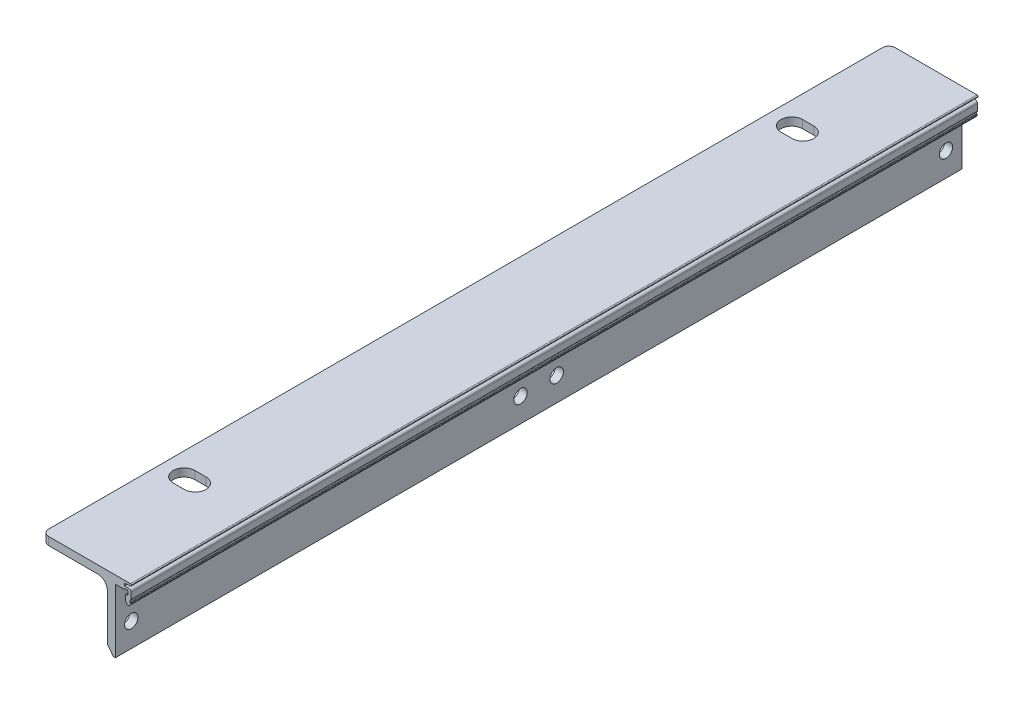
ISO-10303-21;
HEADER;
FILE_DESCRIPTION(('STEP AP214'),'2;1');
FILE_NAME('part.step','',(''),(''),'','','');
FILE_SCHEMA(('AUTOMOTIVE_DESIGN { 1 0 10303 214 1 1 1 1 }'));
ENDSEC;
DATA;
#1=APPLICATION_CONTEXT('core data for automotive mechanical design processes');
#2=APPLICATION_PROTOCOL_DEFINITION('international standard','automotive_design',2000,#1);
#3=PRODUCT_CONTEXT('',#1,'mechanical');
#4=PRODUCT('Part','Part','',(#3));
#5=PRODUCT_RELATED_PRODUCT_CATEGORY('part','',(#4));
#6=PRODUCT_DEFINITION_FORMATION('','',#4);
#7=PRODUCT_DEFINITION_CONTEXT('part definition',#1,'design');
#8=PRODUCT_DEFINITION('design','',#6,#7);
#9=PRODUCT_DEFINITION_SHAPE('','',#8);
#10=(LENGTH_UNIT() NAMED_UNIT(*) SI_UNIT(.MILLI.,.METRE.));
#11=(NAMED_UNIT(*) PLANE_ANGLE_UNIT() SI_UNIT($,.RADIAN.));
#12=(NAMED_UNIT(*) SI_UNIT($,.STERADIAN.) SOLID_ANGLE_UNIT());
#13=UNCERTAINTY_MEASURE_WITH_UNIT(LENGTH_MEASURE(1.E-05),#10,'distance_accuracy_value','');
#14=(GEOMETRIC_REPRESENTATION_CONTEXT(3) GLOBAL_UNCERTAINTY_ASSIGNED_CONTEXT((#13)) GLOBAL_UNIT_ASSIGNED_CONTEXT((#10,
#11,#12)) REPRESENTATION_CONTEXT('',''));
#15=CARTESIAN_POINT('',(0.,0.,0.));
#16=DIRECTION('',(0.,0.,1.));
#17=DIRECTION('',(1.,0.,0.));
#18=AXIS2_PLACEMENT_3D('',#15,#16,#17);
#19=CARTESIAN_POINT('',(2329.98403514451,-3290.10376988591,132.675));
#20=DIRECTION('',(0.,-1.,0.));
#21=DIRECTION('',(1.,0.,0.));
#22=AXIS2_PLACEMENT_3D('',#19,#20,#21);
#23=PLANE('',#22);
#24=DIRECTION('',(-1.,0.,0.));
#25=VECTOR('',#24,1.);
#26=CARTESIAN_POINT('',(2340.4840351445,-3290.10376988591,91.8500000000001));
#27=LINE('',#26,#25);
#28=CARTESIAN_POINT('',(2340.4840351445,-3290.10376988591,91.8500000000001));
#29=VERTEX_POINT('',#28);
#30=CARTESIAN_POINT('',(2336.9840351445,-3290.10376988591,91.8500000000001));
#31=VERTEX_POINT('',#30);
#32=EDGE_CURVE('E380',#29,#31,#27,.T.);
#33=ORIENTED_EDGE('',*,*,#32,.F.);
#34=CARTESIAN_POINT('',(2340.4840351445,-3290.10376988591,95.25));
#35=DIRECTION('',(0.,1.,0.));
#36=DIRECTION('',(1.,0.,0.));
#37=AXIS2_PLACEMENT_3D('',#34,#35,#36);
#38=CIRCLE('',#37,3.39999999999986);
#39=CARTESIAN_POINT('',(2340.4840351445,-3290.10376988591,98.6499999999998));
#40=VERTEX_POINT('',#39);
#41=EDGE_CURVE('E385',#40,#29,#38,.T.);
#42=ORIENTED_EDGE('',*,*,#41,.F.);
#43=DIRECTION('',(1.,0.,0.));
#44=VECTOR('',#43,1.);
#45=CARTESIAN_POINT('',(2340.4840351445,-3290.10376988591,98.6499999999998));
#46=LINE('',#45,#44);
#47=CARTESIAN_POINT('',(2336.9840351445,-3290.10376988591,98.6499999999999));
#48=VERTEX_POINT('',#47);
#49=EDGE_CURVE('E389',#48,#40,#46,.T.);
#50=ORIENTED_EDGE('',*,*,#49,.F.);
#51=CARTESIAN_POINT('',(2336.9840351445,-3290.10376988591,95.25));
#52=DIRECTION('',(0.,1.,0.));
#53=DIRECTION('',(1.,0.,0.));
#54=AXIS2_PLACEMENT_3D('',#51,#52,#53);
#55=CIRCLE('',#54,3.39999999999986);
#56=EDGE_CURVE('E369',#31,#48,#55,.T.);
#57=ORIENTED_EDGE('',*,*,#56,.F.);
#58=EDGE_LOOP('',(#33,#42,#50,#57));
#59=FACE_BOUND('',#58,.T.);
#60=DIRECTION('',(1.,0.,0.));
#61=VECTOR('',#60,1.);
#62=CARTESIAN_POINT('',(2340.4840351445,-3290.10376988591,-91.8500000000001));
#63=LINE('',#62,#61);
#64=CARTESIAN_POINT('',(2336.9840351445,-3290.10376988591,-91.8500000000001));
#65=VERTEX_POINT('',#64);
#66=CARTESIAN_POINT('',(2340.4840351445,-3290.10376988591,-91.8500000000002));
#67=VERTEX_POINT('',#66);
#68=EDGE_CURVE('E400',#65,#67,#63,.T.);
#69=ORIENTED_EDGE('',*,*,#68,.F.);
#70=CARTESIAN_POINT('',(2336.9840351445,-3290.10376988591,-95.25));
#71=DIRECTION('',(0.,1.,0.));
#72=DIRECTION('',(-1.,0.,0.));
#73=AXIS2_PLACEMENT_3D('',#70,#71,#72);
#74=CIRCLE('',#73,3.39999999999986);
#75=CARTESIAN_POINT('',(2336.9840351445,-3290.10376988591,-98.6499999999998));
#76=VERTEX_POINT('',#75);
#77=EDGE_CURVE('E396',#76,#65,#74,.T.);
#78=ORIENTED_EDGE('',*,*,#77,.F.);
#79=DIRECTION('',(-1.,0.,0.));
#80=VECTOR('',#79,1.);
#81=CARTESIAN_POINT('',(2340.4840351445,-3290.10376988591,-98.6499999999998));
#82=LINE('',#81,#80);
#83=CARTESIAN_POINT('',(2340.4840351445,-3290.10376988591,-98.6499999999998));
#84=VERTEX_POINT('',#83);
#85=EDGE_CURVE('E406',#84,#76,#82,.T.);
#86=ORIENTED_EDGE('',*,*,#85,.F.);
#87=CARTESIAN_POINT('',(2340.4840351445,-3290.10376988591,-95.2500000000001));
#88=DIRECTION('',(0.,1.,0.));
#89=DIRECTION('',(-1.,0.,0.));
#90=AXIS2_PLACEMENT_3D('',#87,#88,#89);
#91=CIRCLE('',#90,3.39999999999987);
#92=EDGE_CURVE('E403',#67,#84,#91,.T.);
#93=ORIENTED_EDGE('',*,*,#92,.F.);
#94=EDGE_LOOP('',(#69,#78,#86,#93));
#95=FACE_BOUND('',#94,.T.);
#96=DIRECTION('',(-1.,0.,0.));
#97=VECTOR('',#96,1.);
#98=CARTESIAN_POINT('',(2329.98403514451,-3290.10376988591,-132.675));
#99=LINE('',#98,#97);
#100=CARTESIAN_POINT('',(2357.62403514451,-3290.10376988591,-132.675));
#101=VERTEX_POINT('',#100);
#102=CARTESIAN_POINT('',(2331.98403514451,-3290.10376988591,-132.675));
#103=VERTEX_POINT('',#102);
#104=EDGE_CURVE('E412',#101,#103,#99,.T.);
#105=ORIENTED_EDGE('',*,*,#104,.T.);
#106=CARTESIAN_POINT('',(2331.98403514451,-3290.10376988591,-130.675));
#107=DIRECTION('',(0.,-1.,0.));
#108=DIRECTION('',(1.,0.,0.));
#109=AXIS2_PLACEMENT_3D('',#106,#107,#108);
#110=CIRCLE('',#109,2.);
#111=CARTESIAN_POINT('',(2329.98403514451,-3290.10376988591,-130.675));
#112=VERTEX_POINT('',#111);
#113=EDGE_CURVE('E46',#103,#112,#110,.F.);
#114=ORIENTED_EDGE('',*,*,#113,.T.);
#115=DIRECTION('',(0.,0.,-1.));
#116=VECTOR('',#115,1.);
#117=CARTESIAN_POINT('',(2329.98403514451,-3290.10376988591,132.675));
#118=LINE('',#117,#116);
#119=CARTESIAN_POINT('',(2329.98403514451,-3290.10376988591,130.675));
#120=VERTEX_POINT('',#119);
#121=EDGE_CURVE('E690',#120,#112,#118,.T.);
#122=ORIENTED_EDGE('',*,*,#121,.F.);
#123=CARTESIAN_POINT('',(2331.98403514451,-3290.10376988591,130.675));
#124=DIRECTION('',(0.,-1.,0.));
#125=DIRECTION('',(1.,0.,0.));
#126=AXIS2_PLACEMENT_3D('',#123,#124,#125);
#127=CIRCLE('',#126,2.);
#128=CARTESIAN_POINT('',(2331.98403514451,-3290.10376988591,132.675));
#129=VERTEX_POINT('',#128);
#130=EDGE_CURVE('E53',#120,#129,#127,.F.);
#131=ORIENTED_EDGE('',*,*,#130,.T.);
#132=DIRECTION('',(-1.,0.,0.));
#133=VECTOR('',#132,1.);
#134=CARTESIAN_POINT('',(2355.38403514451,-3290.10376988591,132.675));
#135=LINE('',#134,#133);
#136=CARTESIAN_POINT('',(2357.62403514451,-3290.10376988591,132.675));
#137=VERTEX_POINT('',#136);
#138=EDGE_CURVE('E419',#137,#129,#135,.T.);
#139=ORIENTED_EDGE('',*,*,#138,.F.);
#140=DIRECTION('',(0.,0.,-1.));
#141=VECTOR('',#140,1.);
#142=CARTESIAN_POINT('',(2357.62403514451,-3290.10376988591,132.675));
#143=LINE('',#142,#141);
#144=EDGE_CURVE('E498',#137,#101,#143,.T.);
#145=ORIENTED_EDGE('',*,*,#144,.T.);
#146=EDGE_LOOP('',(#105,#114,#122,#131,#139,#145));
#147=FACE_BOUND('',#146,.T.);
#148=ADVANCED_FACE('F38',(#59,#95,#147),#23,.F.);
#149=CARTESIAN_POINT('',(2329.98403514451,-3290.10376988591,132.675));
#150=DIRECTION('',(1.,0.,0.));
#151=DIRECTION('',(0.,0.,-1.));
#152=AXIS2_PLACEMENT_3D('',#149,#150,#151);
#153=PLANE('',#152);
#154=ORIENTED_EDGE('',*,*,#121,.T.);
#155=DIRECTION('',(0.,-1.,0.));
#156=VECTOR('',#155,1.);
#157=CARTESIAN_POINT('',(2329.98403514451,-3292.60376988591,-130.675));
#158=LINE('',#157,#156);
#159=CARTESIAN_POINT('',(2329.98403514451,-3292.60376988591,-130.675));
#160=VERTEX_POINT('',#159);
#161=EDGE_CURVE('E743',#112,#160,#158,.T.);
#162=ORIENTED_EDGE('',*,*,#161,.T.);
#163=DIRECTION('',(0.,0.,-1.));
#164=VECTOR('',#163,1.);
#165=CARTESIAN_POINT('',(2329.98403514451,-3292.60376988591,132.675));
#166=LINE('',#165,#164);
#167=CARTESIAN_POINT('',(2329.98403514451,-3292.60376988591,130.675));
#168=VERTEX_POINT('',#167);
#169=EDGE_CURVE('E687',#168,#160,#166,.T.);
#170=ORIENTED_EDGE('',*,*,#169,.F.);
#171=DIRECTION('',(0.,-1.,0.));
#172=VECTOR('',#171,1.);
#173=CARTESIAN_POINT('',(2329.98403514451,-3290.10376988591,130.675));
#174=LINE('',#173,#172);
#175=EDGE_CURVE('E725',#168,#120,#174,.F.);
#176=ORIENTED_EDGE('',*,*,#175,.T.);
#177=EDGE_LOOP('',(#154,#162,#170,#176));
#178=FACE_BOUND('',#177,.T.);
#179=ADVANCED_FACE('F755',(#178),#153,.F.);
#180=CARTESIAN_POINT('',(2329.98403514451,-3292.60376988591,132.675));
#181=DIRECTION('',(0.,1.,0.));
#182=DIRECTION('',(0.,0.,1.));
#183=AXIS2_PLACEMENT_3D('',#180,#181,#182);
#184=PLANE('',#183);
#185=DIRECTION('',(1.,0.,0.));
#186=VECTOR('',#185,1.);
#187=CARTESIAN_POINT('',(2329.98403514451,-3292.60376988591,98.6499999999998));
#188=LINE('',#187,#186);
#189=CARTESIAN_POINT('',(2336.9840351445,-3292.60376988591,98.6499999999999));
#190=VERTEX_POINT('',#189);
#191=CARTESIAN_POINT('',(2340.4840351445,-3292.60376988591,98.6499999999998));
#192=VERTEX_POINT('',#191);
#193=EDGE_CURVE('E719',#190,#192,#188,.T.);
#194=ORIENTED_EDGE('',*,*,#193,.T.);
#195=CARTESIAN_POINT('',(2340.4840351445,-3292.60376988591,95.25));
#196=DIRECTION('',(0.,1.,0.));
#197=DIRECTION('',(0.,0.,1.));
#198=AXIS2_PLACEMENT_3D('',#195,#196,#197);
#199=CIRCLE('',#198,3.39999999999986);
#200=CARTESIAN_POINT('',(2340.4840351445,-3292.60376988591,91.8500000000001));
#201=VERTEX_POINT('',#200);
#202=EDGE_CURVE('E722',#192,#201,#199,.T.);
#203=ORIENTED_EDGE('',*,*,#202,.T.);
#204=DIRECTION('',(-1.,0.,0.));
#205=VECTOR('',#204,1.);
#206=CARTESIAN_POINT('',(2329.98403514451,-3292.60376988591,91.8500000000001));
#207=LINE('',#206,#205);
#208=CARTESIAN_POINT('',(2336.9840351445,-3292.60376988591,91.8500000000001));
#209=VERTEX_POINT('',#208);
#210=EDGE_CURVE('E716',#201,#209,#207,.T.);
#211=ORIENTED_EDGE('',*,*,#210,.T.);
#212=CARTESIAN_POINT('',(2336.9840351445,-3292.60376988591,95.25));
#213=DIRECTION('',(0.,1.,0.));
#214=DIRECTION('',(0.,0.,1.));
#215=AXIS2_PLACEMENT_3D('',#212,#213,#214);
#216=CIRCLE('',#215,3.39999999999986);
#217=EDGE_CURVE('E372',#209,#190,#216,.T.);
#218=ORIENTED_EDGE('',*,*,#217,.T.);
#219=EDGE_LOOP('',(#194,#203,#211,#218));
#220=FACE_BOUND('',#219,.T.);
#221=DIRECTION('',(-1.,0.,0.));
#222=VECTOR('',#221,1.);
#223=CARTESIAN_POINT('',(2329.98403514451,-3292.60376988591,-98.6499999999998));
#224=LINE('',#223,#222);
#225=CARTESIAN_POINT('',(2340.4840351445,-3292.60376988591,-98.6499999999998));
#226=VERTEX_POINT('',#225);
#227=CARTESIAN_POINT('',(2336.9840351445,-3292.60376988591,-98.6499999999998));
#228=VERTEX_POINT('',#227);
#229=EDGE_CURVE('E710',#226,#228,#224,.T.);
#230=ORIENTED_EDGE('',*,*,#229,.T.);
#231=CARTESIAN_POINT('',(2336.9840351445,-3292.60376988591,-95.25));
#232=DIRECTION('',(0.,1.,0.));
#233=DIRECTION('',(0.,0.,1.));
#234=AXIS2_PLACEMENT_3D('',#231,#232,#233);
#235=CIRCLE('',#234,3.39999999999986);
#236=CARTESIAN_POINT('',(2336.9840351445,-3292.60376988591,-91.8500000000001));
#237=VERTEX_POINT('',#236);
#238=EDGE_CURVE('E713',#228,#237,#235,.T.);
#239=ORIENTED_EDGE('',*,*,#238,.T.);
#240=DIRECTION('',(1.,0.,0.));
#241=VECTOR('',#240,1.);
#242=CARTESIAN_POINT('',(2329.98403514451,-3292.60376988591,-91.8500000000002));
#243=LINE('',#242,#241);
#244=CARTESIAN_POINT('',(2340.4840351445,-3292.60376988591,-91.8500000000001));
#245=VERTEX_POINT('',#244);
#246=EDGE_CURVE('E704',#237,#245,#243,.T.);
#247=ORIENTED_EDGE('',*,*,#246,.T.);
#248=CARTESIAN_POINT('',(2340.4840351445,-3292.60376988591,-95.2500000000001));
#249=DIRECTION('',(0.,1.,0.));
#250=DIRECTION('',(0.,0.,1.));
#251=AXIS2_PLACEMENT_3D('',#248,#249,#250);
#252=CIRCLE('',#251,3.39999999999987);
#253=EDGE_CURVE('E707',#245,#226,#252,.T.);
#254=ORIENTED_EDGE('',*,*,#253,.T.);
#255=EDGE_LOOP('',(#230,#239,#247,#254));
#256=FACE_BOUND('',#255,.T.);
#257=ORIENTED_EDGE('',*,*,#169,.T.);
#258=CARTESIAN_POINT('',(2331.98403514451,-3292.60376988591,-130.675));
#259=DIRECTION('',(0.,1.,0.));
#260=DIRECTION('',(0.,0.,1.));
#261=AXIS2_PLACEMENT_3D('',#258,#259,#260);
#262=CIRCLE('',#261,2.);
#263=CARTESIAN_POINT('',(2331.98403514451,-3292.60376988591,-132.675));
#264=VERTEX_POINT('',#263);
#265=EDGE_CURVE('E748',#160,#264,#262,.F.);
#266=ORIENTED_EDGE('',*,*,#265,.T.);
#267=DIRECTION('',(1.,0.,0.));
#268=VECTOR('',#267,1.);
#269=CARTESIAN_POINT('',(2329.98403514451,-3292.60376988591,-132.675));
#270=LINE('',#269,#268);
#271=CARTESIAN_POINT('',(2347.3840351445,-3292.60376988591,-132.675));
#272=VERTEX_POINT('',#271);
#273=EDGE_CURVE('E500',#264,#272,#270,.T.);
#274=ORIENTED_EDGE('',*,*,#273,.T.);
#275=DIRECTION('',(0.,0.,-1.));
#276=VECTOR('',#275,1.);
#277=CARTESIAN_POINT('',(2347.3840351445,-3292.60376988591,132.675));
#278=LINE('',#277,#276);
#279=CARTESIAN_POINT('',(2347.3840351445,-3292.60376988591,132.675));
#280=VERTEX_POINT('',#279);
#281=EDGE_CURVE('E696',#272,#280,#278,.F.);
#282=ORIENTED_EDGE('',*,*,#281,.T.);
#283=DIRECTION('',(1.,0.,0.));
#284=VECTOR('',#283,1.);
#285=CARTESIAN_POINT('',(2329.98403514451,-3292.60376988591,132.675));
#286=LINE('',#285,#284);
#287=CARTESIAN_POINT('',(2331.98403514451,-3292.60376988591,132.675));
#288=VERTEX_POINT('',#287);
#289=EDGE_CURVE('E421',#288,#280,#286,.T.);
#290=ORIENTED_EDGE('',*,*,#289,.F.);
#291=CARTESIAN_POINT('',(2331.98403514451,-3292.60376988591,130.675));
#292=DIRECTION('',(0.,1.,0.));
#293=DIRECTION('',(0.,0.,1.));
#294=AXIS2_PLACEMENT_3D('',#291,#292,#293);
#295=CIRCLE('',#294,2.);
#296=EDGE_CURVE('E746',#288,#168,#295,.F.);
#297=ORIENTED_EDGE('',*,*,#296,.T.);
#298=EDGE_LOOP('',(#257,#266,#274,#282,#290,#297));
#299=FACE_BOUND('',#298,.T.);
#300=ADVANCED_FACE('F760',(#220,#256,#299),#184,.F.);
#301=CARTESIAN_POINT('',(2350.3840351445,-3292.60376988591,132.675));
#302=DIRECTION('',(1.,0.,0.));
#303=DIRECTION('',(0.,0.,-1.));
#304=AXIS2_PLACEMENT_3D('',#301,#302,#303);
#305=PLANE('',#304);
#306=CARTESIAN_POINT('',(2350.38403514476,-3305.10376988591,5.67500000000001));
#307=DIRECTION('',(-1.,0.,0.));
#308=DIRECTION('',(0.,-1.,0.));
#309=AXIS2_PLACEMENT_3D('',#306,#307,#308);
#310=CIRCLE('',#309,2.09999999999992);
#311=CARTESIAN_POINT('',(2350.38403514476,-3307.20376988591,5.67500000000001));
#312=VERTEX_POINT('',#311);
#313=EDGE_CURVE('E741',#312,#312,#310,.T.);
#314=ORIENTED_EDGE('',*,*,#313,.F.);
#315=EDGE_LOOP('',(#314));
#316=FACE_BOUND('',#315,.T.);
#317=CARTESIAN_POINT('',(2350.38403514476,-3305.10376988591,-5.67499999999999));
#318=DIRECTION('',(-1.,0.,0.));
#319=DIRECTION('',(0.,-1.,0.));
#320=AXIS2_PLACEMENT_3D('',#317,#318,#319);
#321=CIRCLE('',#320,2.09999999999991);
#322=CARTESIAN_POINT('',(2350.38403514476,-3307.20376988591,-5.67499999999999));
#323=VERTEX_POINT('',#322);
#324=EDGE_CURVE('E737',#323,#323,#321,.T.);
#325=ORIENTED_EDGE('',*,*,#324,.F.);
#326=EDGE_LOOP('',(#325));
#327=FACE_BOUND('',#326,.T.);
#328=CARTESIAN_POINT('',(2350.38403514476,-3305.10376988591,127.675));
#329=DIRECTION('',(-1.,0.,0.));
#330=DIRECTION('',(0.,1.,0.));
#331=AXIS2_PLACEMENT_3D('',#328,#329,#330);
#332=CIRCLE('',#331,2.09999999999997);
#333=CARTESIAN_POINT('',(2350.38403514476,-3303.00376988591,127.675));
#334=VERTEX_POINT('',#333);
#335=EDGE_CURVE('E733',#334,#334,#332,.T.);
#336=ORIENTED_EDGE('',*,*,#335,.F.);
#337=EDGE_LOOP('',(#336));
#338=FACE_BOUND('',#337,.T.);
#339=CARTESIAN_POINT('',(2350.38403514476,-3305.10376988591,-127.675));
#340=DIRECTION('',(-1.,0.,0.));
#341=DIRECTION('',(0.,-1.,0.));
#342=AXIS2_PLACEMENT_3D('',#339,#340,#341);
#343=CIRCLE('',#342,2.09999999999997);
#344=CARTESIAN_POINT('',(2350.38403514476,-3307.20376988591,-127.675));
#345=VERTEX_POINT('',#344);
#346=EDGE_CURVE('E729',#345,#345,#343,.T.);
#347=ORIENTED_EDGE('',*,*,#346,.F.);
#348=EDGE_LOOP('',(#347));
#349=FACE_BOUND('',#348,.T.);
#350=DIRECTION('',(0.,-1.,0.));
#351=VECTOR('',#350,1.);
#352=CARTESIAN_POINT('',(2350.3840351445,-3292.60376988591,132.675));
#353=LINE('',#352,#351);
#354=CARTESIAN_POINT('',(2350.3840351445,-3295.60376988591,132.675));
#355=VERTEX_POINT('',#354);
#356=CARTESIAN_POINT('',(2350.3840351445,-3310.10376988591,132.675));
#357=VERTEX_POINT('',#356);
#358=EDGE_CURVE('E424',#355,#357,#353,.T.);
#359=ORIENTED_EDGE('',*,*,#358,.F.);
#360=DIRECTION('',(0.,0.,-1.));
#361=VECTOR('',#360,1.);
#362=CARTESIAN_POINT('',(2350.3840351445,-3295.60376988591,-132.675));
#363=LINE('',#362,#361);
#364=CARTESIAN_POINT('',(2350.3840351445,-3295.60376988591,-132.675));
#365=VERTEX_POINT('',#364);
#366=EDGE_CURVE('E693',#355,#365,#363,.T.);
#367=ORIENTED_EDGE('',*,*,#366,.T.);
#368=DIRECTION('',(0.,-1.,0.));
#369=VECTOR('',#368,1.);
#370=CARTESIAN_POINT('',(2350.3840351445,-3292.60376988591,-132.675));
#371=LINE('',#370,#369);
#372=CARTESIAN_POINT('',(2350.3840351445,-3310.10376988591,-132.675));
#373=VERTEX_POINT('',#372);
#374=EDGE_CURVE('E502',#365,#373,#371,.T.);
#375=ORIENTED_EDGE('',*,*,#374,.T.);
#376=DIRECTION('',(0.,0.,-1.));
#377=VECTOR('',#376,1.);
#378=CARTESIAN_POINT('',(2350.3840351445,-3310.10376988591,132.675));
#379=LINE('',#378,#377);
#380=EDGE_CURVE('E684',#357,#373,#379,.T.);
#381=ORIENTED_EDGE('',*,*,#380,.F.);
#382=EDGE_LOOP('',(#359,#367,#375,#381));
#383=FACE_BOUND('',#382,.T.);
#384=ADVANCED_FACE('F946',(#316,#327,#338,#349,#383),#305,.F.);
#385=CARTESIAN_POINT('',(2350.3840351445,-3310.10376988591,132.675));
#386=DIRECTION('',(0.796162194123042,0.605083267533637,0.));
#387=DIRECTION('',(-0.605083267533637,0.796162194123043,0.));
#388=AXIS2_PLACEMENT_3D('',#385,#386,#387);
#389=PLANE('',#388);
#390=DIRECTION('',(0.605083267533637,-0.796162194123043,0.));
#391=VECTOR('',#390,1.);
#392=CARTESIAN_POINT('',(2350.3840351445,-3310.10376988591,-132.675));
#393=LINE('',#392,#391);
#394=CARTESIAN_POINT('',(2352.2840351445,-3312.60376988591,-132.675));
#395=VERTEX_POINT('',#394);
#396=EDGE_CURVE('E504',#373,#395,#393,.T.);
#397=ORIENTED_EDGE('',*,*,#396,.T.);
#398=DIRECTION('',(0.,0.,-1.));
#399=VECTOR('',#398,1.);
#400=CARTESIAN_POINT('',(2352.2840351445,-3312.60376988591,132.675));
#401=LINE('',#400,#399);
#402=CARTESIAN_POINT('',(2352.2840351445,-3312.60376988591,132.675));
#403=VERTEX_POINT('',#402);
#404=EDGE_CURVE('E681',#403,#395,#401,.T.);
#405=ORIENTED_EDGE('',*,*,#404,.F.);
#406=DIRECTION('',(0.605083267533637,-0.796162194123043,0.));
#407=VECTOR('',#406,1.);
#408=CARTESIAN_POINT('',(2350.3840351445,-3310.10376988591,132.675));
#409=LINE('',#408,#407);
#410=EDGE_CURVE('E426',#357,#403,#409,.T.);
#411=ORIENTED_EDGE('',*,*,#410,.F.);
#412=ORIENTED_EDGE('',*,*,#380,.T.);
#413=EDGE_LOOP('',(#397,#405,#411,#412));
#414=FACE_BOUND('',#413,.T.);
#415=ADVANCED_FACE('F942',(#414),#389,.F.);
#416=CARTESIAN_POINT('',(2352.8840351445,-3312.60376988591,132.675));
#417=DIRECTION('',(0.,1.,0.));
#418=DIRECTION('',(0.,0.,1.));
#419=AXIS2_PLACEMENT_3D('',#416,#417,#418);
#420=PLANE('',#419);
#421=DIRECTION('',(1.,0.,0.));
#422=VECTOR('',#421,1.);
#423=CARTESIAN_POINT('',(2352.8840351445,-3312.60376988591,-132.675));
#424=LINE('',#423,#422);
#425=CARTESIAN_POINT('',(2352.8840351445,-3312.60376988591,-132.675));
#426=VERTEX_POINT('',#425);
#427=EDGE_CURVE('E506',#395,#426,#424,.T.);
#428=ORIENTED_EDGE('',*,*,#427,.T.);
#429=DIRECTION('',(0.,0.,-1.));
#430=VECTOR('',#429,1.);
#431=CARTESIAN_POINT('',(2352.8840351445,-3312.60376988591,132.675));
#432=LINE('',#431,#430);
#433=CARTESIAN_POINT('',(2352.8840351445,-3312.60376988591,132.675));
#434=VERTEX_POINT('',#433);
#435=EDGE_CURVE('E678',#434,#426,#432,.T.);
#436=ORIENTED_EDGE('',*,*,#435,.F.);
#437=DIRECTION('',(1.,0.,0.));
#438=VECTOR('',#437,1.);
#439=CARTESIAN_POINT('',(2352.8840351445,-3312.60376988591,132.675));
#440=LINE('',#439,#438);
#441=EDGE_CURVE('E428',#403,#434,#440,.T.);
#442=ORIENTED_EDGE('',*,*,#441,.F.);
#443=ORIENTED_EDGE('',*,*,#404,.T.);
#444=EDGE_LOOP('',(#428,#436,#442,#443));
#445=FACE_BOUND('',#444,.T.);
#446=ADVANCED_FACE('F938',(#445),#420,.F.);
#447=CARTESIAN_POINT('',(2352.88403514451,-3292.60376988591,132.675));
#448=DIRECTION('',(-1.,0.,0.));
#449=DIRECTION('',(0.,-1.,0.));
#450=AXIS2_PLACEMENT_3D('',#447,#448,#449);
#451=PLANE('',#450);
#452=CARTESIAN_POINT('',(2352.88403514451,-3305.10376988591,5.67500000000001));
#453=DIRECTION('',(-1.,0.,0.));
#454=DIRECTION('',(0.,-1.,0.));
#455=AXIS2_PLACEMENT_3D('',#452,#453,#454);
#456=CIRCLE('',#455,2.09999999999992);
#457=CARTESIAN_POINT('',(2352.88403514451,-3307.20376988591,5.67500000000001));
#458=VERTEX_POINT('',#457);
#459=EDGE_CURVE('E738',#458,#458,#456,.T.);
#460=ORIENTED_EDGE('',*,*,#459,.T.);
#461=EDGE_LOOP('',(#460));
#462=FACE_BOUND('',#461,.T.);
#463=CARTESIAN_POINT('',(2352.88403514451,-3305.10376988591,-5.67499999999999));
#464=DIRECTION('',(-1.,0.,0.));
#465=DIRECTION('',(0.,-1.,0.));
#466=AXIS2_PLACEMENT_3D('',#463,#464,#465);
#467=CIRCLE('',#466,2.09999999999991);
#468=CARTESIAN_POINT('',(2352.88403514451,-3307.20376988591,-5.67499999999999));
#469=VERTEX_POINT('',#468);
#470=EDGE_CURVE('E734',#469,#469,#467,.T.);
#471=ORIENTED_EDGE('',*,*,#470,.T.);
#472=EDGE_LOOP('',(#471));
#473=FACE_BOUND('',#472,.T.);
#474=CARTESIAN_POINT('',(2352.88403514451,-3305.10376988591,127.675));
#475=DIRECTION('',(-1.,0.,0.));
#476=DIRECTION('',(0.,-1.,0.));
#477=AXIS2_PLACEMENT_3D('',#474,#475,#476);
#478=CIRCLE('',#477,2.09999999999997);
#479=CARTESIAN_POINT('',(2352.88403514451,-3307.20376988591,127.675));
#480=VERTEX_POINT('',#479);
#481=EDGE_CURVE('E730',#480,#480,#478,.T.);
#482=ORIENTED_EDGE('',*,*,#481,.T.);
#483=EDGE_LOOP('',(#482));
#484=FACE_BOUND('',#483,.T.);
#485=CARTESIAN_POINT('',(2352.88403514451,-3305.10376988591,-127.675));
#486=DIRECTION('',(-1.,0.,0.));
#487=DIRECTION('',(0.,-1.,0.));
#488=AXIS2_PLACEMENT_3D('',#485,#486,#487);
#489=CIRCLE('',#488,2.09999999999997);
#490=CARTESIAN_POINT('',(2352.88403514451,-3307.20376988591,-127.675));
#491=VERTEX_POINT('',#490);
#492=EDGE_CURVE('E726',#491,#491,#489,.T.);
#493=ORIENTED_EDGE('',*,*,#492,.T.);
#494=EDGE_LOOP('',(#493));
#495=FACE_BOUND('',#494,.T.);
#496=DIRECTION('',(0.,1.,0.));
#497=VECTOR('',#496,1.);
#498=CARTESIAN_POINT('',(2352.88403514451,-3292.60376988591,-132.675));
#499=LINE('',#498,#497);
#500=CARTESIAN_POINT('',(2352.88403514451,-3292.60376988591,-132.675));
#501=VERTEX_POINT('',#500);
#502=EDGE_CURVE('E508',#426,#501,#499,.T.);
#503=ORIENTED_EDGE('',*,*,#502,.T.);
#504=DIRECTION('',(0.,0.,-1.));
#505=VECTOR('',#504,1.);
#506=CARTESIAN_POINT('',(2352.88403514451,-3292.60376988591,132.675));
#507=LINE('',#506,#505);
#508=CARTESIAN_POINT('',(2352.88403514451,-3292.60376988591,132.675));
#509=VERTEX_POINT('',#508);
#510=EDGE_CURVE('E675',#509,#501,#507,.T.);
#511=ORIENTED_EDGE('',*,*,#510,.F.);
#512=DIRECTION('',(0.,1.,0.));
#513=VECTOR('',#512,1.);
#514=CARTESIAN_POINT('',(2352.88403514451,-3292.60376988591,132.675));
#515=LINE('',#514,#513);
#516=EDGE_CURVE('E430',#434,#509,#515,.T.);
#517=ORIENTED_EDGE('',*,*,#516,.F.);
#518=ORIENTED_EDGE('',*,*,#435,.T.);
#519=EDGE_LOOP('',(#503,#511,#517,#518));
#520=FACE_BOUND('',#519,.T.);
#521=ADVANCED_FACE('F934',(#462,#473,#484,#495,#520),#451,.F.);
#522=CARTESIAN_POINT('',(2355.38403514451,-3292.60376988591,132.675));
#523=DIRECTION('',(0.,1.,0.));
#524=DIRECTION('',(0.,0.,1.));
#525=AXIS2_PLACEMENT_3D('',#522,#523,#524);
#526=PLANE('',#525);
#527=DIRECTION('',(1.,0.,0.));
#528=VECTOR('',#527,1.);
#529=CARTESIAN_POINT('',(2355.38403514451,-3292.60376988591,-132.675));
#530=LINE('',#529,#528);
#531=CARTESIAN_POINT('',(2355.46834905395,-3292.60376988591,-132.675));
#532=VERTEX_POINT('',#531);
#533=EDGE_CURVE('E511',#501,#532,#530,.T.);
#534=ORIENTED_EDGE('',*,*,#533,.T.);
#535=DIRECTION('',(0.,0.,-1.));
#536=VECTOR('',#535,1.);
#537=CARTESIAN_POINT('',(2355.46834905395,-3292.60376988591,132.675));
#538=LINE('',#537,#536);
#539=CARTESIAN_POINT('',(2355.46834905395,-3292.60376988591,132.675));
#540=VERTEX_POINT('',#539);
#541=EDGE_CURVE('E672',#540,#532,#538,.T.);
#542=ORIENTED_EDGE('',*,*,#541,.F.);
#543=DIRECTION('',(1.,-3.55271367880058E-13,0.));
#544=VECTOR('',#543,1.);
#545=CARTESIAN_POINT('',(2352.88403514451,-3292.60376988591,132.675));
#546=LINE('',#545,#544);
#547=EDGE_CURVE('E432',#509,#540,#546,.T.);
#548=ORIENTED_EDGE('',*,*,#547,.F.);
#549=ORIENTED_EDGE('',*,*,#510,.T.);
#550=EDGE_LOOP('',(#534,#542,#548,#549));
#551=FACE_BOUND('',#550,.T.);
#552=ADVANCED_FACE('F930',(#551),#526,.F.);
#553=CARTESIAN_POINT('',(2355.46834905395,-3292.30376988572,132.675));
#554=DIRECTION('',(0.,0.,-1.));
#555=DIRECTION('',(-1.,0.,0.));
#556=AXIS2_PLACEMENT_3D('',#553,#554,#555);
#557=CYLINDRICAL_SURFACE('',#556,0.300000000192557);
#558=CARTESIAN_POINT('',(2355.46834905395,-3292.30376988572,-132.675));
#559=DIRECTION('',(0.,0.,1.));
#560=DIRECTION('',(-1.,0.,0.));
#561=AXIS2_PLACEMENT_3D('',#558,#559,#560);
#562=CIRCLE('',#561,0.300000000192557);
#563=CARTESIAN_POINT('',(2355.72815667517,-3292.45376988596,-132.675));
#564=VERTEX_POINT('',#563);
#565=EDGE_CURVE('E513',#532,#564,#562,.T.);
#566=ORIENTED_EDGE('',*,*,#565,.T.);
#567=DIRECTION('',(0.,0.,-1.));
#568=VECTOR('',#567,1.);
#569=CARTESIAN_POINT('',(2355.72815667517,-3292.45376988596,132.675));
#570=LINE('',#569,#568);
#571=CARTESIAN_POINT('',(2355.72815667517,-3292.45376988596,132.675));
#572=VERTEX_POINT('',#571);
#573=EDGE_CURVE('E669',#572,#564,#570,.T.);
#574=ORIENTED_EDGE('',*,*,#573,.F.);
#575=CARTESIAN_POINT('',(2355.46834905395,-3292.30376988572,132.675));
#576=DIRECTION('',(0.,0.,1.));
#577=DIRECTION('',(-1.,0.,0.));
#578=AXIS2_PLACEMENT_3D('',#575,#576,#577);
#579=CIRCLE('',#578,0.300000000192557);
#580=EDGE_CURVE('E434',#540,#572,#579,.T.);
#581=ORIENTED_EDGE('',*,*,#580,.F.);
#582=ORIENTED_EDGE('',*,*,#541,.T.);
#583=EDGE_LOOP('',(#566,#574,#581,#582));
#584=FACE_BOUND('',#583,.T.);
#585=ADVANCED_FACE('F926',(#584),#557,.T.);
#586=CARTESIAN_POINT('',(2355.9879642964,-3292.60376988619,132.675));
#587=DIRECTION('',(0.,0.,-1.));
#588=DIRECTION('',(-1.,0.,0.));
#589=AXIS2_PLACEMENT_3D('',#586,#587,#588);
#590=CYLINDRICAL_SURFACE('',#589,0.300000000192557);
#591=CARTESIAN_POINT('',(2355.9879642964,-3292.60376988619,-132.675));
#592=DIRECTION('',(0.,0.,-1.));
#593=DIRECTION('',(-1.,0.,0.));
#594=AXIS2_PLACEMENT_3D('',#591,#592,#593);
#595=CIRCLE('',#594,0.300000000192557);
#596=CARTESIAN_POINT('',(2355.9879642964,-3292.303769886,-132.675));
#597=VERTEX_POINT('',#596);
#598=EDGE_CURVE('E515',#564,#597,#595,.T.);
#599=ORIENTED_EDGE('',*,*,#598,.T.);
#600=DIRECTION('',(0.,0.,-1.));
#601=VECTOR('',#600,1.);
#602=CARTESIAN_POINT('',(2355.9879642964,-3292.303769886,132.675));
#603=LINE('',#602,#601);
#604=CARTESIAN_POINT('',(2355.9879642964,-3292.303769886,132.675));
#605=VERTEX_POINT('',#604);
#606=EDGE_CURVE('E666',#605,#597,#603,.T.);
#607=ORIENTED_EDGE('',*,*,#606,.F.);
#608=CARTESIAN_POINT('',(2355.9879642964,-3292.60376988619,132.675));
#609=DIRECTION('',(0.,0.,-1.));
#610=DIRECTION('',(-1.,0.,0.));
#611=AXIS2_PLACEMENT_3D('',#608,#609,#610);
#612=CIRCLE('',#611,0.300000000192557);
#613=EDGE_CURVE('E436',#572,#605,#612,.T.);
#614=ORIENTED_EDGE('',*,*,#613,.F.);
#615=ORIENTED_EDGE('',*,*,#573,.T.);
#616=EDGE_LOOP('',(#599,#607,#614,#615));
#617=FACE_BOUND('',#616,.T.);
#618=ADVANCED_FACE('F922',(#617),#590,.F.);
#619=CARTESIAN_POINT('',(2356.52403514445,-3292.303769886,132.675));
#620=DIRECTION('',(0.,1.,0.));
#621=DIRECTION('',(0.,0.,1.));
#622=AXIS2_PLACEMENT_3D('',#619,#620,#621);
#623=PLANE('',#622);
#624=DIRECTION('',(1.,0.,0.));
#625=VECTOR('',#624,1.);
#626=CARTESIAN_POINT('',(2356.52403514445,-3292.303769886,-132.675));
#627=LINE('',#626,#625);
#628=CARTESIAN_POINT('',(2356.52403514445,-3292.303769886,-132.675));
#629=VERTEX_POINT('',#628);
#630=EDGE_CURVE('E517',#597,#629,#627,.T.);
#631=ORIENTED_EDGE('',*,*,#630,.T.);
#632=DIRECTION('',(0.,0.,-1.));
#633=VECTOR('',#632,1.);
#634=CARTESIAN_POINT('',(2356.52403514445,-3292.303769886,132.675));
#635=LINE('',#634,#633);
#636=CARTESIAN_POINT('',(2356.52403514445,-3292.303769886,132.675));
#637=VERTEX_POINT('',#636);
#638=EDGE_CURVE('E663',#637,#629,#635,.T.);
#639=ORIENTED_EDGE('',*,*,#638,.F.);
#640=DIRECTION('',(1.,0.,0.));
#641=VECTOR('',#640,1.);
#642=CARTESIAN_POINT('',(2356.52403514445,-3292.303769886,132.675));
#643=LINE('',#642,#641);
#644=EDGE_CURVE('E438',#605,#637,#643,.T.);
#645=ORIENTED_EDGE('',*,*,#644,.F.);
#646=ORIENTED_EDGE('',*,*,#606,.T.);
#647=EDGE_LOOP('',(#631,#639,#645,#646));
#648=FACE_BOUND('',#647,.T.);
#649=ADVANCED_FACE('F918',(#648),#623,.F.);
#650=CARTESIAN_POINT('',(2356.52403514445,-3292.603769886,132.675));
#651=DIRECTION('',(0.,0.,-1.));
#652=DIRECTION('',(-1.,0.,0.));
#653=AXIS2_PLACEMENT_3D('',#650,#651,#652);
#654=CYLINDRICAL_SURFACE('',#653,0.300000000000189);
#655=CARTESIAN_POINT('',(2356.52403514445,-3292.603769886,-132.675));
#656=DIRECTION('',(0.,0.,-1.));
#657=DIRECTION('',(-1.,0.,0.));
#658=AXIS2_PLACEMENT_3D('',#655,#656,#657);
#659=CIRCLE('',#658,0.300000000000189);
#660=CARTESIAN_POINT('',(2356.82403514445,-3292.603769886,-132.675));
#661=VERTEX_POINT('',#660);
#662=EDGE_CURVE('E519',#629,#661,#659,.T.);
#663=ORIENTED_EDGE('',*,*,#662,.T.);
#664=DIRECTION('',(0.,0.,-1.));
#665=VECTOR('',#664,1.);
#666=CARTESIAN_POINT('',(2356.82403514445,-3292.603769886,132.675));
#667=LINE('',#666,#665);
#668=CARTESIAN_POINT('',(2356.82403514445,-3292.603769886,132.675));
#669=VERTEX_POINT('',#668);
#670=EDGE_CURVE('E660',#669,#661,#667,.T.);
#671=ORIENTED_EDGE('',*,*,#670,.F.);
#672=CARTESIAN_POINT('',(2356.52403514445,-3292.603769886,132.675));
#673=DIRECTION('',(0.,0.,-1.));
#674=DIRECTION('',(-1.,0.,0.));
#675=AXIS2_PLACEMENT_3D('',#672,#673,#674);
#676=CIRCLE('',#675,0.300000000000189);
#677=EDGE_CURVE('E440',#637,#669,#676,.T.);
#678=ORIENTED_EDGE('',*,*,#677,.F.);
#679=ORIENTED_EDGE('',*,*,#638,.T.);
#680=EDGE_LOOP('',(#663,#671,#678,#679));
#681=FACE_BOUND('',#680,.T.);
#682=ADVANCED_FACE('F914',(#681),#654,.F.);
#683=CARTESIAN_POINT('',(2356.82403514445,-3293.40376988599,132.675));
#684=DIRECTION('',(1.,0.,0.));
#685=DIRECTION('',(0.,0.,-1.));
#686=AXIS2_PLACEMENT_3D('',#683,#684,#685);
#687=PLANE('',#686);
#688=DIRECTION('',(0.,-1.,0.));
#689=VECTOR('',#688,1.);
#690=CARTESIAN_POINT('',(2356.82403514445,-3293.40376988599,-132.675));
#691=LINE('',#690,#689);
#692=CARTESIAN_POINT('',(2356.82403514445,-3293.40376988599,-132.675));
#693=VERTEX_POINT('',#692);
#694=EDGE_CURVE('E521',#661,#693,#691,.T.);
#695=ORIENTED_EDGE('',*,*,#694,.T.);
#696=DIRECTION('',(0.,0.,-1.));
#697=VECTOR('',#696,1.);
#698=CARTESIAN_POINT('',(2356.82403514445,-3293.40376988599,132.675));
#699=LINE('',#698,#697);
#700=CARTESIAN_POINT('',(2356.82403514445,-3293.40376988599,132.675));
#701=VERTEX_POINT('',#700);
#702=EDGE_CURVE('E657',#701,#693,#699,.T.);
#703=ORIENTED_EDGE('',*,*,#702,.F.);
#704=DIRECTION('',(0.,-1.,0.));
#705=VECTOR('',#704,1.);
#706=CARTESIAN_POINT('',(2356.82403514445,-3293.40376988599,132.675));
#707=LINE('',#706,#705);
#708=EDGE_CURVE('E442',#669,#701,#707,.T.);
#709=ORIENTED_EDGE('',*,*,#708,.F.);
#710=ORIENTED_EDGE('',*,*,#670,.T.);
#711=EDGE_LOOP('',(#695,#703,#709,#710));
#712=FACE_BOUND('',#711,.T.);
#713=ADVANCED_FACE('F910',(#712),#687,.F.);
#714=CARTESIAN_POINT('',(2356.52403514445,-3293.40376988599,132.675));
#715=DIRECTION('',(0.,0.,-1.));
#716=DIRECTION('',(-1.,0.,0.));
#717=AXIS2_PLACEMENT_3D('',#714,#715,#716);
#718=CYLINDRICAL_SURFACE('',#717,0.300000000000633);
#719=CARTESIAN_POINT('',(2356.52403514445,-3293.40376988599,-132.675));
#720=DIRECTION('',(0.,0.,-1.));
#721=DIRECTION('',(-1.,0.,0.));
#722=AXIS2_PLACEMENT_3D('',#719,#720,#721);
#723=CIRCLE('',#722,0.300000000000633);
#724=CARTESIAN_POINT('',(2356.52403514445,-3293.70376988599,-132.675));
#725=VERTEX_POINT('',#724);
#726=EDGE_CURVE('E523',#693,#725,#723,.T.);
#727=ORIENTED_EDGE('',*,*,#726,.T.);
#728=DIRECTION('',(0.,0.,-1.));
#729=VECTOR('',#728,1.);
#730=CARTESIAN_POINT('',(2356.52403514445,-3293.70376988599,132.675));
#731=LINE('',#730,#729);
#732=CARTESIAN_POINT('',(2356.52403514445,-3293.70376988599,132.675));
#733=VERTEX_POINT('',#732);
#734=EDGE_CURVE('E654',#733,#725,#731,.T.);
#735=ORIENTED_EDGE('',*,*,#734,.F.);
#736=CARTESIAN_POINT('',(2356.52403514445,-3293.40376988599,132.675));
#737=DIRECTION('',(0.,0.,-1.));
#738=DIRECTION('',(-1.,0.,0.));
#739=AXIS2_PLACEMENT_3D('',#736,#737,#738);
#740=CIRCLE('',#739,0.300000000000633);
#741=EDGE_CURVE('E444',#701,#733,#740,.T.);
#742=ORIENTED_EDGE('',*,*,#741,.F.);
#743=ORIENTED_EDGE('',*,*,#702,.T.);
#744=EDGE_LOOP('',(#727,#735,#742,#743));
#745=FACE_BOUND('',#744,.T.);
#746=ADVANCED_FACE('F906',(#745),#718,.F.);
#747=CARTESIAN_POINT('',(2356.32403514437,-3293.70376988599,132.675));
#748=DIRECTION('',(0.,-1.,0.));
#749=DIRECTION('',(0.,0.,-1.));
#750=AXIS2_PLACEMENT_3D('',#747,#748,#749);
#751=PLANE('',#750);
#752=DIRECTION('',(-1.,0.,0.));
#753=VECTOR('',#752,1.);
#754=CARTESIAN_POINT('',(2356.32403514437,-3293.70376988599,-132.675));
#755=LINE('',#754,#753);
#756=CARTESIAN_POINT('',(2356.32403514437,-3293.70376988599,-132.675));
#757=VERTEX_POINT('',#756);
#758=EDGE_CURVE('E525',#725,#757,#755,.T.);
#759=ORIENTED_EDGE('',*,*,#758,.T.);
#760=DIRECTION('',(0.,0.,-1.));
#761=VECTOR('',#760,1.);
#762=CARTESIAN_POINT('',(2356.32403514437,-3293.70376988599,132.675));
#763=LINE('',#762,#761);
#764=CARTESIAN_POINT('',(2356.32403514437,-3293.70376988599,132.675));
#765=VERTEX_POINT('',#764);
#766=EDGE_CURVE('E651',#765,#757,#763,.T.);
#767=ORIENTED_EDGE('',*,*,#766,.F.);
#768=DIRECTION('',(-1.,0.,0.));
#769=VECTOR('',#768,1.);
#770=CARTESIAN_POINT('',(2356.32403514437,-3293.70376988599,132.675));
#771=LINE('',#770,#769);
#772=EDGE_CURVE('E446',#733,#765,#771,.T.);
#773=ORIENTED_EDGE('',*,*,#772,.F.);
#774=ORIENTED_EDGE('',*,*,#734,.T.);
#775=EDGE_LOOP('',(#759,#767,#773,#774));
#776=FACE_BOUND('',#775,.T.);
#777=ADVANCED_FACE('F902',(#776),#751,.F.);
#778=CARTESIAN_POINT('',(2356.32403514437,-3294.003769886,132.675));
#779=DIRECTION('',(0.,0.,-1.));
#780=DIRECTION('',(-1.,0.,0.));
#781=AXIS2_PLACEMENT_3D('',#778,#779,#780);
#782=CYLINDRICAL_SURFACE('',#781,0.300000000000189);
#783=CARTESIAN_POINT('',(2356.32403514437,-3294.003769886,-132.675));
#784=DIRECTION('',(0.,0.,1.));
#785=DIRECTION('',(-1.,0.,0.));
#786=AXIS2_PLACEMENT_3D('',#783,#784,#785);
#787=CIRCLE('',#786,0.300000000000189);
#788=CARTESIAN_POINT('',(2356.02403514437,-3294.003769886,-132.675));
#789=VERTEX_POINT('',#788);
#790=EDGE_CURVE('E527',#757,#789,#787,.T.);
#791=ORIENTED_EDGE('',*,*,#790,.T.);
#792=DIRECTION('',(0.,0.,-1.));
#793=VECTOR('',#792,1.);
#794=CARTESIAN_POINT('',(2356.02403514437,-3294.003769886,132.675));
#795=LINE('',#794,#793);
#796=CARTESIAN_POINT('',(2356.02403514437,-3294.003769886,132.675));
#797=VERTEX_POINT('',#796);
#798=EDGE_CURVE('E648',#797,#789,#795,.T.);
#799=ORIENTED_EDGE('',*,*,#798,.F.);
#800=CARTESIAN_POINT('',(2356.32403514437,-3294.003769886,132.675));
#801=DIRECTION('',(0.,0.,1.));
#802=DIRECTION('',(-1.,0.,0.));
#803=AXIS2_PLACEMENT_3D('',#800,#801,#802);
#804=CIRCLE('',#803,0.300000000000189);
#805=EDGE_CURVE('E448',#765,#797,#804,.T.);
#806=ORIENTED_EDGE('',*,*,#805,.F.);
#807=ORIENTED_EDGE('',*,*,#766,.T.);
#808=EDGE_LOOP('',(#791,#799,#806,#807));
#809=FACE_BOUND('',#808,.T.);
#810=ADVANCED_FACE('F898',(#809),#782,.T.);
#811=CARTESIAN_POINT('',(2356.02403514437,-3295.45454467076,132.675));
#812=DIRECTION('',(1.,3.06104858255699E-13,0.));
#813=DIRECTION('',(-3.06104858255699E-13,1.,0.));
#814=AXIS2_PLACEMENT_3D('',#811,#812,#813);
#815=PLANE('',#814);
#816=DIRECTION('',(3.06104858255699E-13,-1.,0.));
#817=VECTOR('',#816,1.);
#818=CARTESIAN_POINT('',(2356.02403514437,-3295.45454467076,-132.675));
#819=LINE('',#818,#817);
#820=CARTESIAN_POINT('',(2356.02403514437,-3295.45454467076,-132.675));
#821=VERTEX_POINT('',#820);
#822=EDGE_CURVE('E529',#789,#821,#819,.T.);
#823=ORIENTED_EDGE('',*,*,#822,.T.);
#824=DIRECTION('',(0.,0.,-1.));
#825=VECTOR('',#824,1.);
#826=CARTESIAN_POINT('',(2356.02403514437,-3295.45454467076,132.675));
#827=LINE('',#826,#825);
#828=CARTESIAN_POINT('',(2356.02403514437,-3295.45454467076,132.675));
#829=VERTEX_POINT('',#828);
#830=EDGE_CURVE('E645',#829,#821,#827,.T.);
#831=ORIENTED_EDGE('',*,*,#830,.F.);
#832=DIRECTION('',(3.06104858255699E-13,-1.,0.));
#833=VECTOR('',#832,1.);
#834=CARTESIAN_POINT('',(2356.02403514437,-3295.45454467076,132.675));
#835=LINE('',#834,#833);
#836=EDGE_CURVE('E450',#797,#829,#835,.T.);
#837=ORIENTED_EDGE('',*,*,#836,.F.);
#838=ORIENTED_EDGE('',*,*,#798,.T.);
#839=EDGE_LOOP('',(#823,#831,#837,#838));
#840=FACE_BOUND('',#839,.T.);
#841=ADVANCED_FACE('F894',(#840),#815,.F.);
#842=CARTESIAN_POINT('',(2356.3240351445,-3295.45454467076,132.675));
#843=DIRECTION('',(0.,0.,-1.));
#844=DIRECTION('',(-1.,0.,0.));
#845=AXIS2_PLACEMENT_3D('',#842,#843,#844);
#846=CYLINDRICAL_SURFACE('',#845,0.300000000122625);
#847=CARTESIAN_POINT('',(2356.3240351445,-3295.45454467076,-132.675));
#848=DIRECTION('',(0.,0.,1.));
#849=DIRECTION('',(-1.,0.,0.));
#850=AXIS2_PLACEMENT_3D('',#847,#848,#849);
#851=CIRCLE('',#850,0.300000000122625);
#852=CARTESIAN_POINT('',(2356.09426057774,-3295.64742714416,-132.675));
#853=VERTEX_POINT('',#852);
#854=EDGE_CURVE('E531',#821,#853,#851,.T.);
#855=ORIENTED_EDGE('',*,*,#854,.T.);
#856=DIRECTION('',(0.,0.,-1.));
#857=VECTOR('',#856,1.);
#858=CARTESIAN_POINT('',(2356.09426057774,-3295.64742714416,132.675));
#859=LINE('',#858,#857);
#860=CARTESIAN_POINT('',(2356.09426057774,-3295.64742714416,132.675));
#861=VERTEX_POINT('',#860);
#862=EDGE_CURVE('E642',#861,#853,#859,.T.);
#863=ORIENTED_EDGE('',*,*,#862,.F.);
#864=CARTESIAN_POINT('',(2356.3240351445,-3295.45454467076,132.675));
#865=DIRECTION('',(0.,0.,1.));
#866=DIRECTION('',(-1.,0.,0.));
#867=AXIS2_PLACEMENT_3D('',#864,#865,#866);
#868=CIRCLE('',#867,0.300000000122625);
#869=EDGE_CURVE('E452',#829,#861,#868,.T.);
#870=ORIENTED_EDGE('',*,*,#869,.F.);
#871=ORIENTED_EDGE('',*,*,#830,.T.);
#872=EDGE_LOOP('',(#855,#863,#870,#871));
#873=FACE_BOUND('',#872,.T.);
#874=ADVANCED_FACE('F890',(#873),#846,.T.);
#875=CARTESIAN_POINT('',(2356.46501305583,-3296.08909241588,132.675));
#876=DIRECTION('',(0.765915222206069,0.642941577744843,0.));
#877=DIRECTION('',(-0.642941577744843,0.765915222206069,0.));
#878=AXIS2_PLACEMENT_3D('',#875,#876,#877);
#879=PLANE('',#878);
#880=DIRECTION('',(0.642941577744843,-0.765915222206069,0.));
#881=VECTOR('',#880,1.);
#882=CARTESIAN_POINT('',(2356.46501305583,-3296.08909241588,-132.675));
#883=LINE('',#882,#881);
#884=CARTESIAN_POINT('',(2356.46501305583,-3296.08909241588,-132.675));
#885=VERTEX_POINT('',#884);
#886=EDGE_CURVE('E533',#853,#885,#883,.T.);
#887=ORIENTED_EDGE('',*,*,#886,.T.);
#888=DIRECTION('',(0.,0.,-1.));
#889=VECTOR('',#888,1.);
#890=CARTESIAN_POINT('',(2356.46501305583,-3296.08909241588,132.675));
#891=LINE('',#890,#889);
#892=CARTESIAN_POINT('',(2356.46501305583,-3296.08909241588,132.675));
#893=VERTEX_POINT('',#892);
#894=EDGE_CURVE('E639',#893,#885,#891,.T.);
#895=ORIENTED_EDGE('',*,*,#894,.F.);
#896=DIRECTION('',(0.642941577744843,-0.765915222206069,0.));
#897=VECTOR('',#896,1.);
#898=CARTESIAN_POINT('',(2356.46501305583,-3296.08909241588,132.675));
#899=LINE('',#898,#897);
#900=EDGE_CURVE('E454',#861,#893,#899,.T.);
#901=ORIENTED_EDGE('',*,*,#900,.F.);
#902=ORIENTED_EDGE('',*,*,#862,.T.);
#903=EDGE_LOOP('',(#887,#895,#901,#902));
#904=FACE_BOUND('',#903,.T.);
#905=ADVANCED_FACE('F886',(#904),#879,.F.);
#906=CARTESIAN_POINT('',(2356.92403515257,-3295.703769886,132.675));
#907=DIRECTION('',(0.,0.,-1.));
#908=DIRECTION('',(-1.,0.,0.));
#909=AXIS2_PLACEMENT_3D('',#906,#907,#908);
#910=CYLINDRICAL_SURFACE('',#909,0.599311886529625);
#911=CARTESIAN_POINT('',(2356.92403515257,-3295.703769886,-132.675));
#912=DIRECTION('',(0.,0.,1.));
#913=DIRECTION('',(-1.,0.,0.));
#914=AXIS2_PLACEMENT_3D('',#911,#912,#913);
#915=CIRCLE('',#914,0.599311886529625);
#916=CARTESIAN_POINT('',(2357.38305725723,-3296.08909240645,-132.675));
#917=VERTEX_POINT('',#916);
#918=EDGE_CURVE('E535',#885,#917,#915,.T.);
#919=ORIENTED_EDGE('',*,*,#918,.T.);
#920=DIRECTION('',(0.,0.,-1.));
#921=VECTOR('',#920,1.);
#922=CARTESIAN_POINT('',(2357.38305725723,-3296.08909240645,132.675));
#923=LINE('',#922,#921);
#924=CARTESIAN_POINT('',(2357.38305725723,-3296.08909240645,132.675));
#925=VERTEX_POINT('',#924);
#926=EDGE_CURVE('E636',#925,#917,#923,.T.);
#927=ORIENTED_EDGE('',*,*,#926,.F.);
#928=CARTESIAN_POINT('',(2356.92403515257,-3295.703769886,132.675));
#929=DIRECTION('',(0.,0.,1.));
#930=DIRECTION('',(-1.,0.,0.));
#931=AXIS2_PLACEMENT_3D('',#928,#929,#930);
#932=CIRCLE('',#931,0.599311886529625);
#933=EDGE_CURVE('E456',#893,#925,#932,.T.);
#934=ORIENTED_EDGE('',*,*,#933,.F.);
#935=ORIENTED_EDGE('',*,*,#894,.T.);
#936=EDGE_LOOP('',(#919,#927,#934,#935));
#937=FACE_BOUND('',#936,.T.);
#938=ADVANCED_FACE('F882',(#937),#910,.T.);
#939=CARTESIAN_POINT('',(2357.80062666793,-3295.59165563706,132.675));
#940=DIRECTION('',(-0.765915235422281,0.642941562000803,0.));
#941=DIRECTION('',(-0.642941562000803,-0.765915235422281,0.));
#942=AXIS2_PLACEMENT_3D('',#939,#940,#941);
#943=PLANE('',#942);
#944=DIRECTION('',(0.642941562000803,0.765915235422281,0.));
#945=VECTOR('',#944,1.);
#946=CARTESIAN_POINT('',(2357.80062666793,-3295.59165563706,-132.675));
#947=LINE('',#946,#945);
#948=CARTESIAN_POINT('',(2357.80062666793,-3295.59165563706,-132.675));
#949=VERTEX_POINT('',#948);
#950=EDGE_CURVE('E537',#917,#949,#947,.T.);
#951=ORIENTED_EDGE('',*,*,#950,.T.);
#952=DIRECTION('',(0.,0.,-1.));
#953=VECTOR('',#952,1.);
#954=CARTESIAN_POINT('',(2357.80062666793,-3295.59165563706,132.675));
#955=LINE('',#954,#953);
#956=CARTESIAN_POINT('',(2357.80062666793,-3295.59165563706,132.675));
#957=VERTEX_POINT('',#956);
#958=EDGE_CURVE('E633',#957,#949,#955,.T.);
#959=ORIENTED_EDGE('',*,*,#958,.F.);
#960=DIRECTION('',(0.642941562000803,0.765915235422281,0.));
#961=VECTOR('',#960,1.);
#962=CARTESIAN_POINT('',(2357.80062666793,-3295.59165563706,132.675));
#963=LINE('',#962,#961);
#964=EDGE_CURVE('E458',#925,#957,#963,.T.);
#965=ORIENTED_EDGE('',*,*,#964,.F.);
#966=ORIENTED_EDGE('',*,*,#926,.T.);
#967=EDGE_LOOP('',(#951,#959,#965,#966));
#968=FACE_BOUND('',#967,.T.);
#969=ADVANCED_FACE('F878',(#968),#943,.F.);
#970=CARTESIAN_POINT('',(2357.7240351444,-3295.52736148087,132.675));
#971=DIRECTION('',(0.,0.,-1.));
#972=DIRECTION('',(-1.,0.,0.));
#973=AXIS2_PLACEMENT_3D('',#970,#971,#972);
#974=CYLINDRICAL_SURFACE('',#973,0.0999999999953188);
#975=CARTESIAN_POINT('',(2357.7240351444,-3295.52736148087,-132.675));
#976=DIRECTION('',(0.,0.,1.));
#977=DIRECTION('',(-1.,0.,0.));
#978=AXIS2_PLACEMENT_3D('',#975,#976,#977);
#979=CIRCLE('',#978,0.0999999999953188);
#980=CARTESIAN_POINT('',(2357.82403514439,-3295.52736148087,-132.675));
#981=VERTEX_POINT('',#980);
#982=EDGE_CURVE('E539',#949,#981,#979,.T.);
#983=ORIENTED_EDGE('',*,*,#982,.T.);
#984=DIRECTION('',(0.,0.,-1.));
#985=VECTOR('',#984,1.);
#986=CARTESIAN_POINT('',(2357.82403514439,-3295.52736148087,132.675));
#987=LINE('',#986,#985);
#988=CARTESIAN_POINT('',(2357.82403514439,-3295.52736148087,132.675));
#989=VERTEX_POINT('',#988);
#990=EDGE_CURVE('E630',#989,#981,#987,.T.);
#991=ORIENTED_EDGE('',*,*,#990,.F.);
#992=CARTESIAN_POINT('',(2357.7240351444,-3295.52736148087,132.675));
#993=DIRECTION('',(0.,0.,1.));
#994=DIRECTION('',(-1.,0.,0.));
#995=AXIS2_PLACEMENT_3D('',#992,#993,#994);
#996=CIRCLE('',#995,0.0999999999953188);
#997=EDGE_CURVE('E460',#957,#989,#996,.T.);
#998=ORIENTED_EDGE('',*,*,#997,.F.);
#999=ORIENTED_EDGE('',*,*,#958,.T.);
#1000=EDGE_LOOP('',(#983,#991,#998,#999));
#1001=FACE_BOUND('',#1000,.T.);
#1002=ADVANCED_FACE('F874',(#1001),#974,.T.);
#1003=CARTESIAN_POINT('',(2357.82403514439,-3295.50795991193,132.675));
#1004=DIRECTION('',(-1.,0.,0.));
#1005=DIRECTION('',(0.,0.,1.));
#1006=AXIS2_PLACEMENT_3D('',#1003,#1004,#1005);
#1007=PLANE('',#1006);
#1008=DIRECTION('',(0.,1.,0.));
#1009=VECTOR('',#1008,1.);
#1010=CARTESIAN_POINT('',(2357.82403514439,-3295.50795991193,-132.675));
#1011=LINE('',#1010,#1009);
#1012=CARTESIAN_POINT('',(2357.82403514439,-3295.50795991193,-132.675));
#1013=VERTEX_POINT('',#1012);
#1014=EDGE_CURVE('E541',#981,#1013,#1011,.T.);
#1015=ORIENTED_EDGE('',*,*,#1014,.T.);
#1016=DIRECTION('',(0.,0.,-1.));
#1017=VECTOR('',#1016,1.);
#1018=CARTESIAN_POINT('',(2357.82403514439,-3295.50795991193,132.675));
#1019=LINE('',#1018,#1017);
#1020=CARTESIAN_POINT('',(2357.82403514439,-3295.50795991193,132.675));
#1021=VERTEX_POINT('',#1020);
#1022=EDGE_CURVE('E627',#1021,#1013,#1019,.T.);
#1023=ORIENTED_EDGE('',*,*,#1022,.F.);
#1024=DIRECTION('',(0.,1.,0.));
#1025=VECTOR('',#1024,1.);
#1026=CARTESIAN_POINT('',(2357.82403514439,-3295.50795991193,132.675));
#1027=LINE('',#1026,#1025);
#1028=EDGE_CURVE('E462',#989,#1021,#1027,.T.);
#1029=ORIENTED_EDGE('',*,*,#1028,.F.);
#1030=ORIENTED_EDGE('',*,*,#990,.T.);
#1031=EDGE_LOOP('',(#1015,#1023,#1029,#1030));
#1032=FACE_BOUND('',#1031,.T.);
#1033=ADVANCED_FACE('F870',(#1032),#1007,.F.);
#1034=CARTESIAN_POINT('',(2357.72403514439,-3295.50795991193,132.675));
#1035=DIRECTION('',(0.,0.,-1.));
#1036=DIRECTION('',(-1.,0.,0.));
#1037=AXIS2_PLACEMENT_3D('',#1034,#1035,#1036);
#1038=CYLINDRICAL_SURFACE('',#1037,0.0999999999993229);
#1039=CARTESIAN_POINT('',(2357.72403514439,-3295.50795991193,-132.675));
#1040=DIRECTION('',(0.,0.,1.));
#1041=DIRECTION('',(-1.,0.,0.));
#1042=AXIS2_PLACEMENT_3D('',#1039,#1040,#1041);
#1043=CIRCLE('',#1042,0.0999999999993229);
#1044=CARTESIAN_POINT('',(2357.72403514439,-3295.40795991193,-132.675));
#1045=VERTEX_POINT('',#1044);
#1046=EDGE_CURVE('E543',#1013,#1045,#1043,.T.);
#1047=ORIENTED_EDGE('',*,*,#1046,.T.);
#1048=DIRECTION('',(0.,0.,-1.));
#1049=VECTOR('',#1048,1.);
#1050=CARTESIAN_POINT('',(2357.72403514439,-3295.40795991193,132.675));
#1051=LINE('',#1050,#1049);
#1052=CARTESIAN_POINT('',(2357.72403514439,-3295.40795991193,132.675));
#1053=VERTEX_POINT('',#1052);
#1054=EDGE_CURVE('E624',#1053,#1045,#1051,.T.);
#1055=ORIENTED_EDGE('',*,*,#1054,.F.);
#1056=CARTESIAN_POINT('',(2357.72403514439,-3295.50795991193,132.675));
#1057=DIRECTION('',(0.,0.,1.));
#1058=DIRECTION('',(-1.,0.,0.));
#1059=AXIS2_PLACEMENT_3D('',#1056,#1057,#1058);
#1060=CIRCLE('',#1059,0.0999999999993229);
#1061=EDGE_CURVE('E464',#1021,#1053,#1060,.T.);
#1062=ORIENTED_EDGE('',*,*,#1061,.F.);
#1063=ORIENTED_EDGE('',*,*,#1022,.T.);
#1064=EDGE_LOOP('',(#1047,#1055,#1062,#1063));
#1065=FACE_BOUND('',#1064,.T.);
#1066=ADVANCED_FACE('F866',(#1065),#1038,.T.);
#1067=CARTESIAN_POINT('',(2357.59724022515,-3295.40795991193,132.675));
#1068=DIRECTION('',(0.,-1.,0.));
#1069=DIRECTION('',(0.,0.,-1.));
#1070=AXIS2_PLACEMENT_3D('',#1067,#1068,#1069);
#1071=PLANE('',#1070);
#1072=DIRECTION('',(-1.,0.,0.));
#1073=VECTOR('',#1072,1.);
#1074=CARTESIAN_POINT('',(2357.59724022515,-3295.40795991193,-132.675));
#1075=LINE('',#1074,#1073);
#1076=CARTESIAN_POINT('',(2357.59724022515,-3295.40795991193,-132.675));
#1077=VERTEX_POINT('',#1076);
#1078=EDGE_CURVE('E545',#1045,#1077,#1075,.T.);
#1079=ORIENTED_EDGE('',*,*,#1078,.T.);
#1080=DIRECTION('',(0.,0.,-1.));
#1081=VECTOR('',#1080,1.);
#1082=CARTESIAN_POINT('',(2357.59724022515,-3295.40795991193,132.675));
#1083=LINE('',#1082,#1081);
#1084=CARTESIAN_POINT('',(2357.59724022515,-3295.40795991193,132.675));
#1085=VERTEX_POINT('',#1084);
#1086=EDGE_CURVE('E621',#1085,#1077,#1083,.T.);
#1087=ORIENTED_EDGE('',*,*,#1086,.F.);
#1088=DIRECTION('',(-1.,0.,0.));
#1089=VECTOR('',#1088,1.);
#1090=CARTESIAN_POINT('',(2357.59724022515,-3295.40795991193,132.675));
#1091=LINE('',#1090,#1089);
#1092=EDGE_CURVE('E466',#1053,#1085,#1091,.T.);
#1093=ORIENTED_EDGE('',*,*,#1092,.F.);
#1094=ORIENTED_EDGE('',*,*,#1054,.T.);
#1095=EDGE_LOOP('',(#1079,#1087,#1093,#1094));
#1096=FACE_BOUND('',#1095,.T.);
#1097=ADVANCED_FACE('F862',(#1096),#1071,.F.);
#1098=CARTESIAN_POINT('',(2357.59724022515,-3295.30795991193,132.675));
#1099=DIRECTION('',(0.,0.,-1.));
#1100=DIRECTION('',(-1.,0.,0.));
#1101=AXIS2_PLACEMENT_3D('',#1098,#1099,#1100);
#1102=CYLINDRICAL_SURFACE('',#1101,0.0999999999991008);
#1103=CARTESIAN_POINT('',(2357.59724022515,-3295.30795991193,-132.675));
#1104=DIRECTION('',(0.,0.,-1.));
#1105=DIRECTION('',(-1.,0.,0.));
#1106=AXIS2_PLACEMENT_3D('',#1103,#1104,#1105);
#1107=CIRCLE('',#1106,0.0999999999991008);
#1108=CARTESIAN_POINT('',(2357.49724022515,-3295.30795991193,-132.675));
#1109=VERTEX_POINT('',#1108);
#1110=EDGE_CURVE('E547',#1077,#1109,#1107,.T.);
#1111=ORIENTED_EDGE('',*,*,#1110,.T.);
#1112=DIRECTION('',(0.,0.,-1.));
#1113=VECTOR('',#1112,1.);
#1114=CARTESIAN_POINT('',(2357.49724022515,-3295.30795991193,132.675));
#1115=LINE('',#1114,#1113);
#1116=CARTESIAN_POINT('',(2357.49724022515,-3295.30795991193,132.675));
#1117=VERTEX_POINT('',#1116);
#1118=EDGE_CURVE('E618',#1117,#1109,#1115,.T.);
#1119=ORIENTED_EDGE('',*,*,#1118,.F.);
#1120=CARTESIAN_POINT('',(2357.59724022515,-3295.30795991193,132.675));
#1121=DIRECTION('',(0.,0.,-1.));
#1122=DIRECTION('',(-1.,0.,0.));
#1123=AXIS2_PLACEMENT_3D('',#1120,#1121,#1122);
#1124=CIRCLE('',#1123,0.0999999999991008);
#1125=EDGE_CURVE('E468',#1085,#1117,#1124,.T.);
#1126=ORIENTED_EDGE('',*,*,#1125,.F.);
#1127=ORIENTED_EDGE('',*,*,#1086,.T.);
#1128=EDGE_LOOP('',(#1111,#1119,#1126,#1127));
#1129=FACE_BOUND('',#1128,.T.);
#1130=ADVANCED_FACE('F858',(#1129),#1102,.F.);
#1131=CARTESIAN_POINT('',(2357.49724022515,-3294.80795991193,132.675));
#1132=DIRECTION('',(-1.,0.,0.));
#1133=DIRECTION('',(0.,0.,1.));
#1134=AXIS2_PLACEMENT_3D('',#1131,#1132,#1133);
#1135=PLANE('',#1134);
#1136=DIRECTION('',(0.,1.,0.));
#1137=VECTOR('',#1136,1.);
#1138=CARTESIAN_POINT('',(2357.49724022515,-3294.80795991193,-132.675));
#1139=LINE('',#1138,#1137);
#1140=CARTESIAN_POINT('',(2357.49724022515,-3294.80795991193,-132.675));
#1141=VERTEX_POINT('',#1140);
#1142=EDGE_CURVE('E549',#1109,#1141,#1139,.T.);
#1143=ORIENTED_EDGE('',*,*,#1142,.T.);
#1144=DIRECTION('',(0.,0.,-1.));
#1145=VECTOR('',#1144,1.);
#1146=CARTESIAN_POINT('',(2357.49724022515,-3294.80795991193,132.675));
#1147=LINE('',#1146,#1145);
#1148=CARTESIAN_POINT('',(2357.49724022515,-3294.80795991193,132.675));
#1149=VERTEX_POINT('',#1148);
#1150=EDGE_CURVE('E615',#1149,#1141,#1147,.T.);
#1151=ORIENTED_EDGE('',*,*,#1150,.F.);
#1152=DIRECTION('',(0.,1.,0.));
#1153=VECTOR('',#1152,1.);
#1154=CARTESIAN_POINT('',(2357.49724022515,-3294.80795991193,132.675));
#1155=LINE('',#1154,#1153);
#1156=EDGE_CURVE('E470',#1117,#1149,#1155,.T.);
#1157=ORIENTED_EDGE('',*,*,#1156,.F.);
#1158=ORIENTED_EDGE('',*,*,#1118,.T.);
#1159=EDGE_LOOP('',(#1143,#1151,#1157,#1158));
#1160=FACE_BOUND('',#1159,.T.);
#1161=ADVANCED_FACE('F854',(#1160),#1135,.F.);
#1162=CARTESIAN_POINT('',(2357.79724022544,-3294.80795991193,132.675));
#1163=DIRECTION('',(0.,0.,-1.));
#1164=DIRECTION('',(-1.,0.,0.));
#1165=AXIS2_PLACEMENT_3D('',#1162,#1163,#1164);
#1166=CYLINDRICAL_SURFACE('',#1165,0.300000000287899);
#1167=CARTESIAN_POINT('',(2357.79724022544,-3294.80795991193,-132.675));
#1168=DIRECTION('',(0.,0.,-1.));
#1169=DIRECTION('',(-1.,0.,0.));
#1170=AXIS2_PLACEMENT_3D('',#1167,#1168,#1169);
#1171=CIRCLE('',#1170,0.300000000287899);
#1172=CARTESIAN_POINT('',(2357.66063768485,-3294.54086489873,-132.675));
#1173=VERTEX_POINT('',#1172);
#1174=EDGE_CURVE('E551',#1141,#1173,#1171,.T.);
#1175=ORIENTED_EDGE('',*,*,#1174,.T.);
#1176=DIRECTION('',(0.,0.,-1.));
#1177=VECTOR('',#1176,1.);
#1178=CARTESIAN_POINT('',(2357.66063768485,-3294.54086489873,132.675));
#1179=LINE('',#1178,#1177);
#1180=CARTESIAN_POINT('',(2357.66063768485,-3294.54086489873,132.675));
#1181=VERTEX_POINT('',#1180);
#1182=EDGE_CURVE('E612',#1181,#1173,#1179,.T.);
#1183=ORIENTED_EDGE('',*,*,#1182,.F.);
#1184=CARTESIAN_POINT('',(2357.79724022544,-3294.80795991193,132.675));
#1185=DIRECTION('',(0.,0.,-1.));
#1186=DIRECTION('',(-1.,0.,0.));
#1187=AXIS2_PLACEMENT_3D('',#1184,#1185,#1186);
#1188=CIRCLE('',#1187,0.300000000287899);
#1189=EDGE_CURVE('E472',#1149,#1181,#1188,.T.);
#1190=ORIENTED_EDGE('',*,*,#1189,.F.);
#1191=ORIENTED_EDGE('',*,*,#1150,.T.);
#1192=EDGE_LOOP('',(#1175,#1183,#1190,#1191));
#1193=FACE_BOUND('',#1192,.T.);
#1194=ADVANCED_FACE('F850',(#1193),#1166,.F.);
#1195=CARTESIAN_POINT('',(2357.52403514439,-3294.27376988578,132.675));
#1196=DIRECTION('',(0.,0.,-1.));
#1197=DIRECTION('',(-1.,0.,0.));
#1198=AXIS2_PLACEMENT_3D('',#1195,#1196,#1197);
#1199=CYLINDRICAL_SURFACE('',#1198,0.299999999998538);
#1200=CARTESIAN_POINT('',(2357.52403514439,-3294.27376988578,-132.675));
#1201=DIRECTION('',(0.,0.,1.));
#1202=DIRECTION('',(-1.,0.,0.));
#1203=AXIS2_PLACEMENT_3D('',#1200,#1201,#1202);
#1204=CIRCLE('',#1203,0.299999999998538);
#1205=CARTESIAN_POINT('',(2357.82403514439,-3294.27376988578,-132.675));
#1206=VERTEX_POINT('',#1205);
#1207=EDGE_CURVE('E553',#1173,#1206,#1204,.T.);
#1208=ORIENTED_EDGE('',*,*,#1207,.T.);
#1209=DIRECTION('',(0.,0.,-1.));
#1210=VECTOR('',#1209,1.);
#1211=CARTESIAN_POINT('',(2357.82403514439,-3294.27376988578,132.675));
#1212=LINE('',#1211,#1210);
#1213=CARTESIAN_POINT('',(2357.82403514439,-3294.27376988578,132.675));
#1214=VERTEX_POINT('',#1213);
#1215=EDGE_CURVE('E609',#1214,#1206,#1212,.T.);
#1216=ORIENTED_EDGE('',*,*,#1215,.F.);
#1217=CARTESIAN_POINT('',(2357.52403514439,-3294.27376988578,132.675));
#1218=DIRECTION('',(0.,0.,1.));
#1219=DIRECTION('',(-1.,0.,0.));
#1220=AXIS2_PLACEMENT_3D('',#1217,#1218,#1219);
#1221=CIRCLE('',#1220,0.299999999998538);
#1222=EDGE_CURVE('E474',#1181,#1214,#1221,.T.);
#1223=ORIENTED_EDGE('',*,*,#1222,.F.);
#1224=ORIENTED_EDGE('',*,*,#1182,.T.);
#1225=EDGE_LOOP('',(#1208,#1216,#1223,#1224));
#1226=FACE_BOUND('',#1225,.T.);
#1227=ADVANCED_FACE('F846',(#1226),#1199,.T.);
#1228=CARTESIAN_POINT('',(2357.82403514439,-3292.37595209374,132.675));
#1229=DIRECTION('',(-1.,0.,0.));
#1230=DIRECTION('',(0.,0.,1.));
#1231=AXIS2_PLACEMENT_3D('',#1228,#1229,#1230);
#1232=PLANE('',#1231);
#1233=DIRECTION('',(0.,1.,0.));
#1234=VECTOR('',#1233,1.);
#1235=CARTESIAN_POINT('',(2357.82403514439,-3292.37595209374,-132.675));
#1236=LINE('',#1235,#1234);
#1237=CARTESIAN_POINT('',(2357.82403514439,-3292.37595209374,-132.675));
#1238=VERTEX_POINT('',#1237);
#1239=EDGE_CURVE('E555',#1206,#1238,#1236,.T.);
#1240=ORIENTED_EDGE('',*,*,#1239,.T.);
#1241=DIRECTION('',(0.,0.,-1.));
#1242=VECTOR('',#1241,1.);
#1243=CARTESIAN_POINT('',(2357.82403514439,-3292.37595209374,132.675));
#1244=LINE('',#1243,#1242);
#1245=CARTESIAN_POINT('',(2357.82403514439,-3292.37595209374,132.675));
#1246=VERTEX_POINT('',#1245);
#1247=EDGE_CURVE('E606',#1246,#1238,#1244,.T.);
#1248=ORIENTED_EDGE('',*,*,#1247,.F.);
#1249=DIRECTION('',(0.,1.,0.));
#1250=VECTOR('',#1249,1.);
#1251=CARTESIAN_POINT('',(2357.82403514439,-3292.37595209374,132.675));
#1252=LINE('',#1251,#1250);
#1253=EDGE_CURVE('E476',#1214,#1246,#1252,.T.);
#1254=ORIENTED_EDGE('',*,*,#1253,.F.);
#1255=ORIENTED_EDGE('',*,*,#1215,.T.);
#1256=EDGE_LOOP('',(#1240,#1248,#1254,#1255));
#1257=FACE_BOUND('',#1256,.T.);
#1258=ADVANCED_FACE('F842',(#1257),#1232,.F.);
#1259=CARTESIAN_POINT('',(2357.32403514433,-3292.37595209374,132.675));
#1260=DIRECTION('',(0.,0.,-1.));
#1261=DIRECTION('',(-1.,0.,0.));
#1262=AXIS2_PLACEMENT_3D('',#1259,#1260,#1261);
#1263=CYLINDRICAL_SURFACE('',#1262,0.50000000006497);
#1264=CARTESIAN_POINT('',(2357.32403514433,-3292.37595209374,-132.675));
#1265=DIRECTION('',(0.,0.,1.));
#1266=DIRECTION('',(-1.,0.,0.));
#1267=AXIS2_PLACEMENT_3D('',#1264,#1265,#1266);
#1268=CIRCLE('',#1267,0.50000000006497);
#1269=CARTESIAN_POINT('',(2357.7197854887,-3292.07036795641,-132.675));
#1270=VERTEX_POINT('',#1269);
#1271=EDGE_CURVE('E557',#1238,#1270,#1268,.T.);
#1272=ORIENTED_EDGE('',*,*,#1271,.T.);
#1273=DIRECTION('',(0.,0.,-1.));
#1274=VECTOR('',#1273,1.);
#1275=CARTESIAN_POINT('',(2357.7197854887,-3292.07036795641,132.675));
#1276=LINE('',#1275,#1274);
#1277=CARTESIAN_POINT('',(2357.7197854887,-3292.07036795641,132.675));
#1278=VERTEX_POINT('',#1277);
#1279=EDGE_CURVE('E603',#1278,#1270,#1276,.T.);
#1280=ORIENTED_EDGE('',*,*,#1279,.F.);
#1281=CARTESIAN_POINT('',(2357.32403514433,-3292.37595209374,132.675));
#1282=DIRECTION('',(0.,0.,1.));
#1283=DIRECTION('',(-1.,0.,0.));
#1284=AXIS2_PLACEMENT_3D('',#1281,#1282,#1283);
#1285=CIRCLE('',#1284,0.50000000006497);
#1286=EDGE_CURVE('E478',#1246,#1278,#1285,.T.);
#1287=ORIENTED_EDGE('',*,*,#1286,.F.);
#1288=ORIENTED_EDGE('',*,*,#1247,.T.);
#1289=EDGE_LOOP('',(#1272,#1280,#1287,#1288));
#1290=FACE_BOUND('',#1289,.T.);
#1291=ADVANCED_FACE('F838',(#1290),#1263,.T.);
#1292=CARTESIAN_POINT('',(2356.76998466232,-3292.80376988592,132.675));
#1293=DIRECTION('',(0.,0.,-1.));
#1294=DIRECTION('',(-1.,0.,0.));
#1295=AXIS2_PLACEMENT_3D('',#1292,#1293,#1294);
#1296=CYLINDRICAL_SURFACE('',#1295,1.19999999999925);
#1297=CARTESIAN_POINT('',(2356.76998466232,-3292.80376988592,-132.675));
#1298=DIRECTION('',(0.,0.,1.));
#1299=DIRECTION('',(-1.,0.,0.));
#1300=AXIS2_PLACEMENT_3D('',#1297,#1298,#1299);
#1301=CIRCLE('',#1300,1.19999999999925);
#1302=CARTESIAN_POINT('',(2356.76998466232,-3291.60376988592,-132.675));
#1303=VERTEX_POINT('',#1302);
#1304=EDGE_CURVE('E559',#1270,#1303,#1301,.T.);
#1305=ORIENTED_EDGE('',*,*,#1304,.T.);
#1306=DIRECTION('',(0.,0.,-1.));
#1307=VECTOR('',#1306,1.);
#1308=CARTESIAN_POINT('',(2356.76998466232,-3291.60376988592,132.675));
#1309=LINE('',#1308,#1307);
#1310=CARTESIAN_POINT('',(2356.76998466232,-3291.60376988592,132.675));
#1311=VERTEX_POINT('',#1310);
#1312=EDGE_CURVE('E600',#1311,#1303,#1309,.T.);
#1313=ORIENTED_EDGE('',*,*,#1312,.F.);
#1314=CARTESIAN_POINT('',(2356.76998466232,-3292.80376988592,132.675));
#1315=DIRECTION('',(0.,0.,1.));
#1316=DIRECTION('',(-1.,0.,0.));
#1317=AXIS2_PLACEMENT_3D('',#1314,#1315,#1316);
#1318=CIRCLE('',#1317,1.19999999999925);
#1319=EDGE_CURVE('E480',#1278,#1311,#1318,.T.);
#1320=ORIENTED_EDGE('',*,*,#1319,.F.);
#1321=ORIENTED_EDGE('',*,*,#1279,.T.);
#1322=EDGE_LOOP('',(#1305,#1313,#1320,#1321));
#1323=FACE_BOUND('',#1322,.T.);
#1324=ADVANCED_FACE('F834',(#1323),#1296,.T.);
#1325=CARTESIAN_POINT('',(2355.9240351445,-3291.60376988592,132.675));
#1326=DIRECTION('',(0.,-1.,0.));
#1327=DIRECTION('',(0.,0.,-1.));
#1328=AXIS2_PLACEMENT_3D('',#1325,#1326,#1327);
#1329=PLANE('',#1328);
#1330=DIRECTION('',(-1.,0.,0.));
#1331=VECTOR('',#1330,1.);
#1332=CARTESIAN_POINT('',(2355.9240351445,-3291.60376988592,-132.675));
#1333=LINE('',#1332,#1331);
#1334=CARTESIAN_POINT('',(2355.9240351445,-3291.60376988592,-132.675));
#1335=VERTEX_POINT('',#1334);
#1336=EDGE_CURVE('E561',#1303,#1335,#1333,.T.);
#1337=ORIENTED_EDGE('',*,*,#1336,.T.);
#1338=DIRECTION('',(0.,0.,-1.));
#1339=VECTOR('',#1338,1.);
#1340=CARTESIAN_POINT('',(2355.9240351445,-3291.60376988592,132.675));
#1341=LINE('',#1340,#1339);
#1342=CARTESIAN_POINT('',(2355.9240351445,-3291.60376988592,132.675));
#1343=VERTEX_POINT('',#1342);
#1344=EDGE_CURVE('E597',#1343,#1335,#1341,.T.);
#1345=ORIENTED_EDGE('',*,*,#1344,.F.);
#1346=DIRECTION('',(-1.,0.,0.));
#1347=VECTOR('',#1346,1.);
#1348=CARTESIAN_POINT('',(2355.9240351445,-3291.60376988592,132.675));
#1349=LINE('',#1348,#1347);
#1350=EDGE_CURVE('E482',#1311,#1343,#1349,.T.);
#1351=ORIENTED_EDGE('',*,*,#1350,.F.);
#1352=ORIENTED_EDGE('',*,*,#1312,.T.);
#1353=EDGE_LOOP('',(#1337,#1345,#1351,#1352));
#1354=FACE_BOUND('',#1353,.T.);
#1355=ADVANCED_FACE('F830',(#1354),#1329,.F.);
#1356=CARTESIAN_POINT('',(2355.9240351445,-3291.40376988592,132.675));
#1357=DIRECTION('',(0.,0.,-1.));
#1358=DIRECTION('',(-1.,0.,0.));
#1359=AXIS2_PLACEMENT_3D('',#1356,#1357,#1358);
#1360=CYLINDRICAL_SURFACE('',#1359,0.200000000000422);
#1361=CARTESIAN_POINT('',(2355.9240351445,-3291.40376988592,-132.675));
#1362=DIRECTION('',(0.,0.,-1.));
#1363=DIRECTION('',(-1.,0.,0.));
#1364=AXIS2_PLACEMENT_3D('',#1361,#1362,#1363);
#1365=CIRCLE('',#1364,0.200000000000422);
#1366=CARTESIAN_POINT('',(2355.7240351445,-3291.40376988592,-132.675));
#1367=VERTEX_POINT('',#1366);
#1368=EDGE_CURVE('E563',#1335,#1367,#1365,.T.);
#1369=ORIENTED_EDGE('',*,*,#1368,.T.);
#1370=DIRECTION('',(0.,0.,-1.));
#1371=VECTOR('',#1370,1.);
#1372=CARTESIAN_POINT('',(2355.7240351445,-3291.40376988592,132.675));
#1373=LINE('',#1372,#1371);
#1374=CARTESIAN_POINT('',(2355.7240351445,-3291.40376988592,132.675));
#1375=VERTEX_POINT('',#1374);
#1376=EDGE_CURVE('E594',#1375,#1367,#1373,.T.);
#1377=ORIENTED_EDGE('',*,*,#1376,.F.);
#1378=CARTESIAN_POINT('',(2355.9240351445,-3291.40376988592,132.675));
#1379=DIRECTION('',(0.,0.,-1.));
#1380=DIRECTION('',(-1.,0.,0.));
#1381=AXIS2_PLACEMENT_3D('',#1378,#1379,#1380);
#1382=CIRCLE('',#1381,0.200000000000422);
#1383=EDGE_CURVE('E484',#1343,#1375,#1382,.T.);
#1384=ORIENTED_EDGE('',*,*,#1383,.F.);
#1385=ORIENTED_EDGE('',*,*,#1344,.T.);
#1386=EDGE_LOOP('',(#1369,#1377,#1384,#1385));
#1387=FACE_BOUND('',#1386,.T.);
#1388=ADVANCED_FACE('F826',(#1387),#1360,.F.);
#1389=CARTESIAN_POINT('',(2355.7240351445,-3291.08385069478,132.675));
#1390=DIRECTION('',(-1.,1.38812932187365E-12,0.));
#1391=DIRECTION('',(-1.38812932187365E-12,-1.,0.));
#1392=AXIS2_PLACEMENT_3D('',#1389,#1390,#1391);
#1393=PLANE('',#1392);
#1394=DIRECTION('',(1.38812932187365E-12,1.,0.));
#1395=VECTOR('',#1394,1.);
#1396=CARTESIAN_POINT('',(2355.7240351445,-3291.08385069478,-132.675));
#1397=LINE('',#1396,#1395);
#1398=CARTESIAN_POINT('',(2355.7240351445,-3291.08385069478,-132.675));
#1399=VERTEX_POINT('',#1398);
#1400=EDGE_CURVE('E565',#1367,#1399,#1397,.T.);
#1401=ORIENTED_EDGE('',*,*,#1400,.T.);
#1402=DIRECTION('',(0.,0.,-1.));
#1403=VECTOR('',#1402,1.);
#1404=CARTESIAN_POINT('',(2355.7240351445,-3291.08385069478,132.675));
#1405=LINE('',#1404,#1403);
#1406=CARTESIAN_POINT('',(2355.7240351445,-3291.08385069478,132.675));
#1407=VERTEX_POINT('',#1406);
#1408=EDGE_CURVE('E591',#1407,#1399,#1405,.T.);
#1409=ORIENTED_EDGE('',*,*,#1408,.F.);
#1410=DIRECTION('',(1.38812932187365E-12,1.,0.));
#1411=VECTOR('',#1410,1.);
#1412=CARTESIAN_POINT('',(2355.7240351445,-3291.08385069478,132.675));
#1413=LINE('',#1412,#1411);
#1414=EDGE_CURVE('E486',#1375,#1407,#1413,.T.);
#1415=ORIENTED_EDGE('',*,*,#1414,.F.);
#1416=ORIENTED_EDGE('',*,*,#1376,.T.);
#1417=EDGE_LOOP('',(#1401,#1409,#1415,#1416));
#1418=FACE_BOUND('',#1417,.T.);
#1419=ADVANCED_FACE('F822',(#1418),#1393,.F.);
#1420=CARTESIAN_POINT('',(2355.9240351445,-3291.08385069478,132.675));
#1421=DIRECTION('',(0.,0.,-1.));
#1422=DIRECTION('',(-1.,0.,0.));
#1423=AXIS2_PLACEMENT_3D('',#1420,#1421,#1422);
#1424=CYLINDRICAL_SURFACE('',#1423,0.19999999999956);
#1425=CARTESIAN_POINT('',(2355.9240351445,-3291.08385069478,-132.675));
#1426=DIRECTION('',(0.,0.,-1.));
#1427=DIRECTION('',(-1.,0.,0.));
#1428=AXIS2_PLACEMENT_3D('',#1425,#1426,#1427);
#1429=CIRCLE('',#1428,0.19999999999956);
#1430=CARTESIAN_POINT('',(2355.90312945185,-3290.88494631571,-132.675));
#1431=VERTEX_POINT('',#1430);
#1432=EDGE_CURVE('E567',#1399,#1431,#1429,.T.);
#1433=ORIENTED_EDGE('',*,*,#1432,.T.);
#1434=DIRECTION('',(0.,0.,-1.));
#1435=VECTOR('',#1434,1.);
#1436=CARTESIAN_POINT('',(2355.90312945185,-3290.88494631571,132.675));
#1437=LINE('',#1436,#1435);
#1438=CARTESIAN_POINT('',(2355.90312945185,-3290.88494631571,132.675));
#1439=VERTEX_POINT('',#1438);
#1440=EDGE_CURVE('E588',#1439,#1431,#1437,.T.);
#1441=ORIENTED_EDGE('',*,*,#1440,.F.);
#1442=CARTESIAN_POINT('',(2355.9240351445,-3291.08385069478,132.675));
#1443=DIRECTION('',(0.,0.,-1.));
#1444=DIRECTION('',(-1.,0.,0.));
#1445=AXIS2_PLACEMENT_3D('',#1442,#1443,#1444);
#1446=CIRCLE('',#1445,0.19999999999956);
#1447=EDGE_CURVE('E488',#1407,#1439,#1446,.T.);
#1448=ORIENTED_EDGE('',*,*,#1447,.F.);
#1449=ORIENTED_EDGE('',*,*,#1408,.T.);
#1450=EDGE_LOOP('',(#1433,#1441,#1448,#1449));
#1451=FACE_BOUND('',#1450,.T.);
#1452=ADVANCED_FACE('F818',(#1451),#1424,.F.);
#1453=CARTESIAN_POINT('',(2357.74494083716,-3290.69136413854,132.675));
#1454=DIRECTION('',(-0.104528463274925,0.994521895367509,0.));
#1455=DIRECTION('',(-0.994521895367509,-0.104528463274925,0.));
#1456=AXIS2_PLACEMENT_3D('',#1453,#1454,#1455);
#1457=PLANE('',#1456);
#1458=DIRECTION('',(0.994521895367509,0.104528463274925,0.));
#1459=VECTOR('',#1458,1.);
#1460=CARTESIAN_POINT('',(2357.74494083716,-3290.69136413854,-132.675));
#1461=LINE('',#1460,#1459);
#1462=CARTESIAN_POINT('',(2357.74494083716,-3290.69136413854,-132.675));
#1463=VERTEX_POINT('',#1462);
#1464=EDGE_CURVE('E569',#1431,#1463,#1461,.T.);
#1465=ORIENTED_EDGE('',*,*,#1464,.T.);
#1466=DIRECTION('',(0.,0.,-1.));
#1467=VECTOR('',#1466,1.);
#1468=CARTESIAN_POINT('',(2357.74494083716,-3290.69136413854,132.675));
#1469=LINE('',#1468,#1467);
#1470=CARTESIAN_POINT('',(2357.74494083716,-3290.69136413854,132.675));
#1471=VERTEX_POINT('',#1470);
#1472=EDGE_CURVE('E585',#1471,#1463,#1469,.T.);
#1473=ORIENTED_EDGE('',*,*,#1472,.F.);
#1474=DIRECTION('',(0.994521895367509,0.104528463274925,0.));
#1475=VECTOR('',#1474,1.);
#1476=CARTESIAN_POINT('',(2357.74494083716,-3290.69136413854,132.675));
#1477=LINE('',#1476,#1475);
#1478=EDGE_CURVE('E490',#1439,#1471,#1477,.T.);
#1479=ORIENTED_EDGE('',*,*,#1478,.F.);
#1480=ORIENTED_EDGE('',*,*,#1440,.T.);
#1481=EDGE_LOOP('',(#1465,#1473,#1479,#1480));
#1482=FACE_BOUND('',#1481,.T.);
#1483=ADVANCED_FACE('F814',(#1482),#1457,.F.);
#1484=CARTESIAN_POINT('',(2357.72403514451,-3290.49245975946,132.675));
#1485=DIRECTION('',(0.,0.,-1.));
#1486=DIRECTION('',(-1.,0.,0.));
#1487=AXIS2_PLACEMENT_3D('',#1484,#1485,#1486);
#1488=CYLINDRICAL_SURFACE('',#1487,0.200000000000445);
#1489=CARTESIAN_POINT('',(2357.72403514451,-3290.49245975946,-132.675));
#1490=DIRECTION('',(0.,0.,1.));
#1491=DIRECTION('',(-1.,0.,0.));
#1492=AXIS2_PLACEMENT_3D('',#1489,#1490,#1491);
#1493=CIRCLE('',#1492,0.200000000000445);
#1494=CARTESIAN_POINT('',(2357.92403514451,-3290.49245975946,-132.675));
#1495=VERTEX_POINT('',#1494);
#1496=EDGE_CURVE('E571',#1463,#1495,#1493,.T.);
#1497=ORIENTED_EDGE('',*,*,#1496,.T.);
#1498=DIRECTION('',(0.,0.,-1.));
#1499=VECTOR('',#1498,1.);
#1500=CARTESIAN_POINT('',(2357.92403514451,-3290.49245975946,132.675));
#1501=LINE('',#1500,#1499);
#1502=CARTESIAN_POINT('',(2357.92403514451,-3290.49245975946,132.675));
#1503=VERTEX_POINT('',#1502);
#1504=EDGE_CURVE('E582',#1503,#1495,#1501,.T.);
#1505=ORIENTED_EDGE('',*,*,#1504,.F.);
#1506=CARTESIAN_POINT('',(2357.72403514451,-3290.49245975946,132.675));
#1507=DIRECTION('',(0.,0.,1.));
#1508=DIRECTION('',(-1.,0.,0.));
#1509=AXIS2_PLACEMENT_3D('',#1506,#1507,#1508);
#1510=CIRCLE('',#1509,0.200000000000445);
#1511=EDGE_CURVE('E492',#1471,#1503,#1510,.T.);
#1512=ORIENTED_EDGE('',*,*,#1511,.F.);
#1513=ORIENTED_EDGE('',*,*,#1472,.T.);
#1514=EDGE_LOOP('',(#1497,#1505,#1512,#1513));
#1515=FACE_BOUND('',#1514,.T.);
#1516=ADVANCED_FACE('F810',(#1515),#1488,.T.);
#1517=CARTESIAN_POINT('',(2357.92403514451,-3290.40376988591,132.675));
#1518=DIRECTION('',(-1.,-1.00144287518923E-11,0.));
#1519=DIRECTION('',(1.00144287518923E-11,-1.,0.));
#1520=AXIS2_PLACEMENT_3D('',#1517,#1518,#1519);
#1521=PLANE('',#1520);
#1522=DIRECTION('',(-1.00144287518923E-11,1.,0.));
#1523=VECTOR('',#1522,1.);
#1524=CARTESIAN_POINT('',(2357.92403514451,-3290.40376988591,-132.675));
#1525=LINE('',#1524,#1523);
#1526=CARTESIAN_POINT('',(2357.92403514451,-3290.40376988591,-132.675));
#1527=VERTEX_POINT('',#1526);
#1528=EDGE_CURVE('E573',#1495,#1527,#1525,.T.);
#1529=ORIENTED_EDGE('',*,*,#1528,.T.);
#1530=DIRECTION('',(0.,0.,-1.));
#1531=VECTOR('',#1530,1.);
#1532=CARTESIAN_POINT('',(2357.92403514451,-3290.40376988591,132.675));
#1533=LINE('',#1532,#1531);
#1534=CARTESIAN_POINT('',(2357.92403514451,-3290.40376988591,132.675));
#1535=VERTEX_POINT('',#1534);
#1536=EDGE_CURVE('E579',#1535,#1527,#1533,.T.);
#1537=ORIENTED_EDGE('',*,*,#1536,.F.);
#1538=DIRECTION('',(-1.00144287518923E-11,1.,0.));
#1539=VECTOR('',#1538,1.);
#1540=CARTESIAN_POINT('',(2357.92403514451,-3290.40376988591,132.675));
#1541=LINE('',#1540,#1539);
#1542=EDGE_CURVE('E494',#1503,#1535,#1541,.T.);
#1543=ORIENTED_EDGE('',*,*,#1542,.F.);
#1544=ORIENTED_EDGE('',*,*,#1504,.T.);
#1545=EDGE_LOOP('',(#1529,#1537,#1543,#1544));
#1546=FACE_BOUND('',#1545,.T.);
#1547=ADVANCED_FACE('F806',(#1546),#1521,.F.);
#1548=CARTESIAN_POINT('',(2357.62403514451,-3290.40376988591,132.675));
#1549=DIRECTION('',(0.,0.,-1.));
#1550=DIRECTION('',(-1.,0.,0.));
#1551=AXIS2_PLACEMENT_3D('',#1548,#1549,#1550);
#1552=CYLINDRICAL_SURFACE('',#1551,0.299999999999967);
#1553=CARTESIAN_POINT('',(2357.62403514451,-3290.40376988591,-132.675));
#1554=DIRECTION('',(0.,0.,1.));
#1555=DIRECTION('',(-1.,0.,0.));
#1556=AXIS2_PLACEMENT_3D('',#1553,#1554,#1555);
#1557=CIRCLE('',#1556,0.299999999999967);
#1558=EDGE_CURVE('E422',#1527,#101,#1557,.T.);
#1559=ORIENTED_EDGE('',*,*,#1558,.T.);
#1560=ORIENTED_EDGE('',*,*,#144,.F.);
#1561=CARTESIAN_POINT('',(2357.62403514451,-3290.40376988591,132.675));
#1562=DIRECTION('',(0.,0.,1.));
#1563=DIRECTION('',(-1.,0.,0.));
#1564=AXIS2_PLACEMENT_3D('',#1561,#1562,#1563);
#1565=CIRCLE('',#1564,0.299999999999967);
#1566=EDGE_CURVE('E496',#1535,#137,#1565,.T.);
#1567=ORIENTED_EDGE('',*,*,#1566,.F.);
#1568=ORIENTED_EDGE('',*,*,#1536,.T.);
#1569=EDGE_LOOP('',(#1559,#1560,#1567,#1568));
#1570=FACE_BOUND('',#1569,.T.);
#1571=ADVANCED_FACE('F801',(#1570),#1552,.T.);
#1572=CARTESIAN_POINT('',(2357.62403514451,-3290.40376988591,132.675));
#1573=DIRECTION('',(0.,0.,-1.));
#1574=DIRECTION('',(-1.,0.,0.));
#1575=AXIS2_PLACEMENT_3D('',#1572,#1573,#1574);
#1576=PLANE('',#1575);
#1577=ORIENTED_EDGE('',*,*,#138,.T.);
#1578=DIRECTION('',(0.,-1.,0.));
#1579=VECTOR('',#1578,1.);
#1580=CARTESIAN_POINT('',(2331.98403514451,-3290.40376988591,132.675));
#1581=LINE('',#1580,#1579);
#1582=EDGE_CURVE('E11',#129,#288,#1581,.T.);
#1583=ORIENTED_EDGE('',*,*,#1582,.T.);
#1584=ORIENTED_EDGE('',*,*,#289,.T.);
#1585=CARTESIAN_POINT('',(2347.3840351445,-3295.60376988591,132.675));
#1586=DIRECTION('',(0.,0.,-1.));
#1587=DIRECTION('',(-1.,0.,0.));
#1588=AXIS2_PLACEMENT_3D('',#1585,#1586,#1587);
#1589=CIRCLE('',#1588,3.);
#1590=EDGE_CURVE('E702',#280,#355,#1589,.T.);
#1591=ORIENTED_EDGE('',*,*,#1590,.T.);
#1592=ORIENTED_EDGE('',*,*,#358,.T.);
#1593=ORIENTED_EDGE('',*,*,#410,.T.);
#1594=ORIENTED_EDGE('',*,*,#441,.T.);
#1595=ORIENTED_EDGE('',*,*,#516,.T.);
#1596=ORIENTED_EDGE('',*,*,#547,.T.);
#1597=ORIENTED_EDGE('',*,*,#580,.T.);
#1598=ORIENTED_EDGE('',*,*,#613,.T.);
#1599=ORIENTED_EDGE('',*,*,#644,.T.);
#1600=ORIENTED_EDGE('',*,*,#677,.T.);
#1601=ORIENTED_EDGE('',*,*,#708,.T.);
#1602=ORIENTED_EDGE('',*,*,#741,.T.);
#1603=ORIENTED_EDGE('',*,*,#772,.T.);
#1604=ORIENTED_EDGE('',*,*,#805,.T.);
#1605=ORIENTED_EDGE('',*,*,#836,.T.);
#1606=ORIENTED_EDGE('',*,*,#869,.T.);
#1607=ORIENTED_EDGE('',*,*,#900,.T.);
#1608=ORIENTED_EDGE('',*,*,#933,.T.);
#1609=ORIENTED_EDGE('',*,*,#964,.T.);
#1610=ORIENTED_EDGE('',*,*,#997,.T.);
#1611=ORIENTED_EDGE('',*,*,#1028,.T.);
#1612=ORIENTED_EDGE('',*,*,#1061,.T.);
#1613=ORIENTED_EDGE('',*,*,#1092,.T.);
#1614=ORIENTED_EDGE('',*,*,#1125,.T.);
#1615=ORIENTED_EDGE('',*,*,#1156,.T.);
#1616=ORIENTED_EDGE('',*,*,#1189,.T.);
#1617=ORIENTED_EDGE('',*,*,#1222,.T.);
#1618=ORIENTED_EDGE('',*,*,#1253,.T.);
#1619=ORIENTED_EDGE('',*,*,#1286,.T.);
#1620=ORIENTED_EDGE('',*,*,#1319,.T.);
#1621=ORIENTED_EDGE('',*,*,#1350,.T.);
#1622=ORIENTED_EDGE('',*,*,#1383,.T.);
#1623=ORIENTED_EDGE('',*,*,#1414,.T.);
#1624=ORIENTED_EDGE('',*,*,#1447,.T.);
#1625=ORIENTED_EDGE('',*,*,#1478,.T.);
#1626=ORIENTED_EDGE('',*,*,#1511,.T.);
#1627=ORIENTED_EDGE('',*,*,#1542,.T.);
#1628=ORIENTED_EDGE('',*,*,#1566,.T.);
#1629=EDGE_LOOP('',(#1577,#1583,#1584,#1591,#1592,#1593,#1594,#1595,#1596,#1597,#1598,#1599,
#1600,#1601,#1602,#1603,#1604,#1605,#1606,#1607,#1608,#1609,#1610,#1611,#1612,#1613,#1614,#1615,
#1616,#1617,#1618,#1619,#1620,#1621,#1622,#1623,#1624,#1625,#1626,#1627,#1628));
#1630=FACE_BOUND('',#1629,.T.);
#1631=ADVANCED_FACE('F771',(#1630),#1576,.F.);
#1632=CARTESIAN_POINT('',(2357.62403514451,-3290.40376988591,-132.675));
#1633=DIRECTION('',(0.,0.,-1.));
#1634=DIRECTION('',(-1.,0.,0.));
#1635=AXIS2_PLACEMENT_3D('',#1632,#1633,#1634);
#1636=PLANE('',#1635);
#1637=ORIENTED_EDGE('',*,*,#273,.F.);
#1638=DIRECTION('',(0.,-1.,0.));
#1639=VECTOR('',#1638,1.);
#1640=CARTESIAN_POINT('',(2331.98403514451,-3290.10376988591,-132.675));
#1641=LINE('',#1640,#1639);
#1642=EDGE_CURVE('E61',#264,#103,#1641,.F.);
#1643=ORIENTED_EDGE('',*,*,#1642,.T.);
#1644=ORIENTED_EDGE('',*,*,#104,.F.);
#1645=ORIENTED_EDGE('',*,*,#1558,.F.);
#1646=ORIENTED_EDGE('',*,*,#1528,.F.);
#1647=ORIENTED_EDGE('',*,*,#1496,.F.);
#1648=ORIENTED_EDGE('',*,*,#1464,.F.);
#1649=ORIENTED_EDGE('',*,*,#1432,.F.);
#1650=ORIENTED_EDGE('',*,*,#1400,.F.);
#1651=ORIENTED_EDGE('',*,*,#1368,.F.);
#1652=ORIENTED_EDGE('',*,*,#1336,.F.);
#1653=ORIENTED_EDGE('',*,*,#1304,.F.);
#1654=ORIENTED_EDGE('',*,*,#1271,.F.);
#1655=ORIENTED_EDGE('',*,*,#1239,.F.);
#1656=ORIENTED_EDGE('',*,*,#1207,.F.);
#1657=ORIENTED_EDGE('',*,*,#1174,.F.);
#1658=ORIENTED_EDGE('',*,*,#1142,.F.);
#1659=ORIENTED_EDGE('',*,*,#1110,.F.);
#1660=ORIENTED_EDGE('',*,*,#1078,.F.);
#1661=ORIENTED_EDGE('',*,*,#1046,.F.);
#1662=ORIENTED_EDGE('',*,*,#1014,.F.);
#1663=ORIENTED_EDGE('',*,*,#982,.F.);
#1664=ORIENTED_EDGE('',*,*,#950,.F.);
#1665=ORIENTED_EDGE('',*,*,#918,.F.);
#1666=ORIENTED_EDGE('',*,*,#886,.F.);
#1667=ORIENTED_EDGE('',*,*,#854,.F.);
#1668=ORIENTED_EDGE('',*,*,#822,.F.);
#1669=ORIENTED_EDGE('',*,*,#790,.F.);
#1670=ORIENTED_EDGE('',*,*,#758,.F.);
#1671=ORIENTED_EDGE('',*,*,#726,.F.);
#1672=ORIENTED_EDGE('',*,*,#694,.F.);
#1673=ORIENTED_EDGE('',*,*,#662,.F.);
#1674=ORIENTED_EDGE('',*,*,#630,.F.);
#1675=ORIENTED_EDGE('',*,*,#598,.F.);
#1676=ORIENTED_EDGE('',*,*,#565,.F.);
#1677=ORIENTED_EDGE('',*,*,#533,.F.);
#1678=ORIENTED_EDGE('',*,*,#502,.F.);
#1679=ORIENTED_EDGE('',*,*,#427,.F.);
#1680=ORIENTED_EDGE('',*,*,#396,.F.);
#1681=ORIENTED_EDGE('',*,*,#374,.F.);
#1682=CARTESIAN_POINT('',(2347.3840351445,-3295.60376988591,-132.675));
#1683=DIRECTION('',(0.,0.,-1.));
#1684=DIRECTION('',(-1.,0.,0.));
#1685=AXIS2_PLACEMENT_3D('',#1682,#1683,#1684);
#1686=CIRCLE('',#1685,3.);
#1687=EDGE_CURVE('E699',#365,#272,#1686,.F.);
#1688=ORIENTED_EDGE('',*,*,#1687,.T.);
#1689=EDGE_LOOP('',(#1637,#1643,#1644,#1645,#1646,#1647,#1648,#1649,#1650,#1651,#1652,#1653,
#1654,#1655,#1656,#1657,#1658,#1659,#1660,#1661,#1662,#1663,#1664,#1665,#1666,#1667,#1668,#1669,
#1670,#1671,#1672,#1673,#1674,#1675,#1676,#1677,#1678,#1679,#1680,#1681,#1688));
#1690=FACE_BOUND('',#1689,.T.);
#1691=ADVANCED_FACE('F761',(#1690),#1636,.T.);
#1692=CARTESIAN_POINT('',(2347.3840351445,-3295.60376988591,132.675));
#1693=DIRECTION('',(0.,0.,1.));
#1694=DIRECTION('',(1.,0.,0.));
#1695=AXIS2_PLACEMENT_3D('',#1692,#1693,#1694);
#1696=CYLINDRICAL_SURFACE('',#1695,3.);
#1697=ORIENTED_EDGE('',*,*,#1590,.F.);
#1698=ORIENTED_EDGE('',*,*,#281,.F.);
#1699=ORIENTED_EDGE('',*,*,#1687,.F.);
#1700=ORIENTED_EDGE('',*,*,#366,.F.);
#1701=EDGE_LOOP('',(#1697,#1698,#1699,#1700));
#1702=FACE_BOUND('',#1701,.T.);
#1703=ADVANCED_FACE('F768',(#1702),#1696,.F.);
#1704=CARTESIAN_POINT('',(2336.9840351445,-3312.60376988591,-95.25));
#1705=DIRECTION('',(0.,1.,0.));
#1706=DIRECTION('',(-1.,0.,0.));
#1707=AXIS2_PLACEMENT_3D('',#1704,#1705,#1706);
#1708=CYLINDRICAL_SURFACE('',#1707,3.39999999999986);
#1709=DIRECTION('',(0.,1.,0.));
#1710=VECTOR('',#1709,1.);
#1711=CARTESIAN_POINT('',(2336.9840351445,-3312.60376988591,-98.6499999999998));
#1712=LINE('',#1711,#1710);
#1713=EDGE_CURVE('E410',#228,#76,#1712,.T.);
#1714=ORIENTED_EDGE('',*,*,#1713,.T.);
#1715=ORIENTED_EDGE('',*,*,#77,.T.);
#1716=DIRECTION('',(0.,1.,0.));
#1717=VECTOR('',#1716,1.);
#1718=CARTESIAN_POINT('',(2336.9840351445,-3312.60376988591,-91.8500000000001));
#1719=LINE('',#1718,#1717);
#1720=EDGE_CURVE('E409',#237,#65,#1719,.T.);
#1721=ORIENTED_EDGE('',*,*,#1720,.F.);
#1722=ORIENTED_EDGE('',*,*,#238,.F.);
#1723=EDGE_LOOP('',(#1714,#1715,#1721,#1722));
#1724=FACE_BOUND('',#1723,.T.);
#1725=ADVANCED_FACE('F789',(#1724),#1708,.F.);
#1726=CARTESIAN_POINT('',(2340.4840351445,-3312.60376988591,-98.6499999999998));
#1727=DIRECTION('',(0.,0.,-1.));
#1728=DIRECTION('',(-1.,0.,0.));
#1729=AXIS2_PLACEMENT_3D('',#1726,#1727,#1728);
#1730=PLANE('',#1729);
#1731=DIRECTION('',(0.,1.,0.));
#1732=VECTOR('',#1731,1.);
#1733=CARTESIAN_POINT('',(2340.4840351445,-3312.60376988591,-98.6499999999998));
#1734=LINE('',#1733,#1732);
#1735=EDGE_CURVE('E413',#226,#84,#1734,.T.);
#1736=ORIENTED_EDGE('',*,*,#1735,.T.);
#1737=ORIENTED_EDGE('',*,*,#85,.T.);
#1738=ORIENTED_EDGE('',*,*,#1713,.F.);
#1739=ORIENTED_EDGE('',*,*,#229,.F.);
#1740=EDGE_LOOP('',(#1736,#1737,#1738,#1739));
#1741=FACE_BOUND('',#1740,.T.);
#1742=ADVANCED_FACE('F794',(#1741),#1730,.F.);
#1743=CARTESIAN_POINT('',(2340.4840351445,-3312.60376988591,-95.2500000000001));
#1744=DIRECTION('',(0.,1.,0.));
#1745=DIRECTION('',(-1.,0.,0.));
#1746=AXIS2_PLACEMENT_3D('',#1743,#1744,#1745);
#1747=CYLINDRICAL_SURFACE('',#1746,3.39999999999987);
#1748=DIRECTION('',(0.,1.,0.));
#1749=VECTOR('',#1748,1.);
#1750=CARTESIAN_POINT('',(2340.4840351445,-3312.60376988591,-91.8500000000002));
#1751=LINE('',#1750,#1749);
#1752=EDGE_CURVE('E415',#245,#67,#1751,.T.);
#1753=ORIENTED_EDGE('',*,*,#1752,.T.);
#1754=ORIENTED_EDGE('',*,*,#92,.T.);
#1755=ORIENTED_EDGE('',*,*,#1735,.F.);
#1756=ORIENTED_EDGE('',*,*,#253,.F.);
#1757=EDGE_LOOP('',(#1753,#1754,#1755,#1756));
#1758=FACE_BOUND('',#1757,.T.);
#1759=ADVANCED_FACE('F960',(#1758),#1747,.F.);
#1760=CARTESIAN_POINT('',(2340.4840351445,-3312.60376988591,-91.8500000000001));
#1761=DIRECTION('',(0.,0.,1.));
#1762=DIRECTION('',(1.,0.,0.));
#1763=AXIS2_PLACEMENT_3D('',#1760,#1761,#1762);
#1764=PLANE('',#1763);
#1765=ORIENTED_EDGE('',*,*,#1720,.T.);
#1766=ORIENTED_EDGE('',*,*,#68,.T.);
#1767=ORIENTED_EDGE('',*,*,#1752,.F.);
#1768=ORIENTED_EDGE('',*,*,#246,.F.);
#1769=EDGE_LOOP('',(#1765,#1766,#1767,#1768));
#1770=FACE_BOUND('',#1769,.T.);
#1771=ADVANCED_FACE('F967',(#1770),#1764,.F.);
#1772=CARTESIAN_POINT('',(2340.4840351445,-3312.60376988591,95.25));
#1773=DIRECTION('',(0.,1.,0.));
#1774=DIRECTION('',(-1.,0.,0.));
#1775=AXIS2_PLACEMENT_3D('',#1772,#1773,#1774);
#1776=CYLINDRICAL_SURFACE('',#1775,3.39999999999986);
#1777=DIRECTION('',(0.,1.,0.));
#1778=VECTOR('',#1777,1.);
#1779=CARTESIAN_POINT('',(2340.4840351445,-3312.60376988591,98.6499999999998));
#1780=LINE('',#1779,#1778);
#1781=EDGE_CURVE('E394',#192,#40,#1780,.T.);
#1782=ORIENTED_EDGE('',*,*,#1781,.T.);
#1783=ORIENTED_EDGE('',*,*,#41,.T.);
#1784=DIRECTION('',(0.,1.,0.));
#1785=VECTOR('',#1784,1.);
#1786=CARTESIAN_POINT('',(2340.4840351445,-3312.60376988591,91.8500000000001));
#1787=LINE('',#1786,#1785);
#1788=EDGE_CURVE('E376',#201,#29,#1787,.T.);
#1789=ORIENTED_EDGE('',*,*,#1788,.F.);
#1790=ORIENTED_EDGE('',*,*,#202,.F.);
#1791=EDGE_LOOP('',(#1782,#1783,#1789,#1790));
#1792=FACE_BOUND('',#1791,.T.);
#1793=ADVANCED_FACE('F969',(#1792),#1776,.F.);
#1794=CARTESIAN_POINT('',(2340.4840351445,-3312.60376988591,98.6499999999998));
#1795=DIRECTION('',(0.,0.,1.));
#1796=DIRECTION('',(1.,0.,0.));
#1797=AXIS2_PLACEMENT_3D('',#1794,#1795,#1796);
#1798=PLANE('',#1797);
#1799=DIRECTION('',(0.,1.,0.));
#1800=VECTOR('',#1799,1.);
#1801=CARTESIAN_POINT('',(2336.9840351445,-3312.60376988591,98.6499999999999));
#1802=LINE('',#1801,#1800);
#1803=EDGE_CURVE('E375',#190,#48,#1802,.T.);
#1804=ORIENTED_EDGE('',*,*,#1803,.T.);
#1805=ORIENTED_EDGE('',*,*,#49,.T.);
#1806=ORIENTED_EDGE('',*,*,#1781,.F.);
#1807=ORIENTED_EDGE('',*,*,#193,.F.);
#1808=EDGE_LOOP('',(#1804,#1805,#1806,#1807));
#1809=FACE_BOUND('',#1808,.T.);
#1810=ADVANCED_FACE('F975',(#1809),#1798,.F.);
#1811=CARTESIAN_POINT('',(2336.9840351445,-3312.60376988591,95.25));
#1812=DIRECTION('',(0.,1.,0.));
#1813=DIRECTION('',(-1.,0.,0.));
#1814=AXIS2_PLACEMENT_3D('',#1811,#1812,#1813);
#1815=CYLINDRICAL_SURFACE('',#1814,3.39999999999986);
#1816=DIRECTION('',(0.,1.,0.));
#1817=VECTOR('',#1816,1.);
#1818=CARTESIAN_POINT('',(2336.9840351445,-3312.60376988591,91.8500000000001));
#1819=LINE('',#1818,#1817);
#1820=EDGE_CURVE('E364',#209,#31,#1819,.T.);
#1821=ORIENTED_EDGE('',*,*,#1820,.T.);
#1822=ORIENTED_EDGE('',*,*,#56,.T.);
#1823=ORIENTED_EDGE('',*,*,#1803,.F.);
#1824=ORIENTED_EDGE('',*,*,#217,.F.);
#1825=EDGE_LOOP('',(#1821,#1822,#1823,#1824));
#1826=FACE_BOUND('',#1825,.T.);
#1827=ADVANCED_FACE('F366',(#1826),#1815,.F.);
#1828=CARTESIAN_POINT('',(2340.4840351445,-3312.60376988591,91.8500000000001));
#1829=DIRECTION('',(0.,0.,-1.));
#1830=DIRECTION('',(-1.,0.,0.));
#1831=AXIS2_PLACEMENT_3D('',#1828,#1829,#1830);
#1832=PLANE('',#1831);
#1833=ORIENTED_EDGE('',*,*,#1788,.T.);
#1834=ORIENTED_EDGE('',*,*,#32,.T.);
#1835=ORIENTED_EDGE('',*,*,#1820,.F.);
#1836=ORIENTED_EDGE('',*,*,#210,.F.);
#1837=EDGE_LOOP('',(#1833,#1834,#1835,#1836));
#1838=FACE_BOUND('',#1837,.T.);
#1839=ADVANCED_FACE('F381',(#1838),#1832,.F.);
#1840=CARTESIAN_POINT('',(2357.92403514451,-3305.10376988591,-127.675));
#1841=DIRECTION('',(-1.,0.,0.));
#1842=DIRECTION('',(0.,-1.,0.));
#1843=AXIS2_PLACEMENT_3D('',#1840,#1841,#1842);
#1844=CYLINDRICAL_SURFACE('',#1843,2.09999999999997);
#1845=ORIENTED_EDGE('',*,*,#346,.T.);
#1846=EDGE_LOOP('',(#1845));
#1847=FACE_BOUND('',#1846,.T.);
#1848=ORIENTED_EDGE('',*,*,#492,.F.);
#1849=EDGE_LOOP('',(#1848));
#1850=FACE_BOUND('',#1849,.T.);
#1851=ADVANCED_FACE('F984',(#1847,#1850),#1844,.F.);
#1852=CARTESIAN_POINT('',(2357.92403514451,-3305.10376988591,127.675));
#1853=DIRECTION('',(-1.,0.,0.));
#1854=DIRECTION('',(0.,-1.,0.));
#1855=AXIS2_PLACEMENT_3D('',#1852,#1853,#1854);
#1856=CYLINDRICAL_SURFACE('',#1855,2.09999999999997);
#1857=ORIENTED_EDGE('',*,*,#335,.T.);
#1858=EDGE_LOOP('',(#1857));
#1859=FACE_BOUND('',#1858,.T.);
#1860=ORIENTED_EDGE('',*,*,#481,.F.);
#1861=EDGE_LOOP('',(#1860));
#1862=FACE_BOUND('',#1861,.T.);
#1863=ADVANCED_FACE('F992',(#1859,#1862),#1856,.F.);
#1864=CARTESIAN_POINT('',(2357.92403514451,-3305.10376988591,-5.67499999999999));
#1865=DIRECTION('',(-1.,0.,0.));
#1866=DIRECTION('',(0.,-1.,0.));
#1867=AXIS2_PLACEMENT_3D('',#1864,#1865,#1866);
#1868=CYLINDRICAL_SURFACE('',#1867,2.09999999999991);
#1869=ORIENTED_EDGE('',*,*,#324,.T.);
#1870=EDGE_LOOP('',(#1869));
#1871=FACE_BOUND('',#1870,.T.);
#1872=ORIENTED_EDGE('',*,*,#470,.F.);
#1873=EDGE_LOOP('',(#1872));
#1874=FACE_BOUND('',#1873,.T.);
#1875=ADVANCED_FACE('F996',(#1871,#1874),#1868,.F.);
#1876=CARTESIAN_POINT('',(2357.92403514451,-3305.10376988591,5.67500000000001));
#1877=DIRECTION('',(-1.,0.,0.));
#1878=DIRECTION('',(0.,-1.,0.));
#1879=AXIS2_PLACEMENT_3D('',#1876,#1877,#1878);
#1880=CYLINDRICAL_SURFACE('',#1879,2.09999999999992);
#1881=ORIENTED_EDGE('',*,*,#313,.T.);
#1882=EDGE_LOOP('',(#1881));
#1883=FACE_BOUND('',#1882,.T.);
#1884=ORIENTED_EDGE('',*,*,#459,.F.);
#1885=EDGE_LOOP('',(#1884));
#1886=FACE_BOUND('',#1885,.T.);
#1887=ADVANCED_FACE('F779',(#1883,#1886),#1880,.F.);
#1888=CARTESIAN_POINT('',(2331.98403514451,-3290.10376988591,-130.675));
#1889=DIRECTION('',(0.,1.,0.));
#1890=DIRECTION('',(0.,0.,1.));
#1891=AXIS2_PLACEMENT_3D('',#1888,#1889,#1890);
#1892=CYLINDRICAL_SURFACE('',#1891,2.);
#1893=ORIENTED_EDGE('',*,*,#113,.F.);
#1894=ORIENTED_EDGE('',*,*,#1642,.F.);
#1895=ORIENTED_EDGE('',*,*,#265,.F.);
#1896=ORIENTED_EDGE('',*,*,#161,.F.);
#1897=EDGE_LOOP('',(#1893,#1894,#1895,#1896));
#1898=FACE_BOUND('',#1897,.T.);
#1899=ADVANCED_FACE('F758',(#1898),#1892,.T.);
#1900=CARTESIAN_POINT('',(2331.98403514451,-3290.40376988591,130.675));
#1901=DIRECTION('',(0.,-1.,0.));
#1902=DIRECTION('',(0.,0.,-1.));
#1903=AXIS2_PLACEMENT_3D('',#1900,#1901,#1902);
#1904=CYLINDRICAL_SURFACE('',#1903,2.);
#1905=ORIENTED_EDGE('',*,*,#130,.F.);
#1906=ORIENTED_EDGE('',*,*,#175,.F.);
#1907=ORIENTED_EDGE('',*,*,#296,.F.);
#1908=ORIENTED_EDGE('',*,*,#1582,.F.);
#1909=EDGE_LOOP('',(#1905,#1906,#1907,#1908));
#1910=FACE_BOUND('',#1909,.T.);
#1911=ADVANCED_FACE('F40',(#1910),#1904,.T.);
#1912=CLOSED_SHELL('',(#148,#179,#300,#384,#415,#446,#521,#552,#585,#618,#649,#682,#713,#746,
#777,#810,#841,#874,#905,#938,#969,#1002,#1033,#1066,#1097,#1130,#1161,#1194,#1227,#1258,#1291,
#1324,#1355,#1388,#1419,#1452,#1483,#1516,#1547,#1571,#1631,#1691,#1703,#1725,#1742,#1759,#1771,
#1793,#1810,#1827,#1839,#1851,#1863,#1875,#1887,#1899,#1911));
#1913=MANIFOLD_SOLID_BREP('B2',#1912);
#1914=ADVANCED_BREP_SHAPE_REPRESENTATION('',(#18,#1913),#14);
#1915=SHAPE_DEFINITION_REPRESENTATION(#9,#1914);
ENDSEC;
END-ISO-10303-21;
